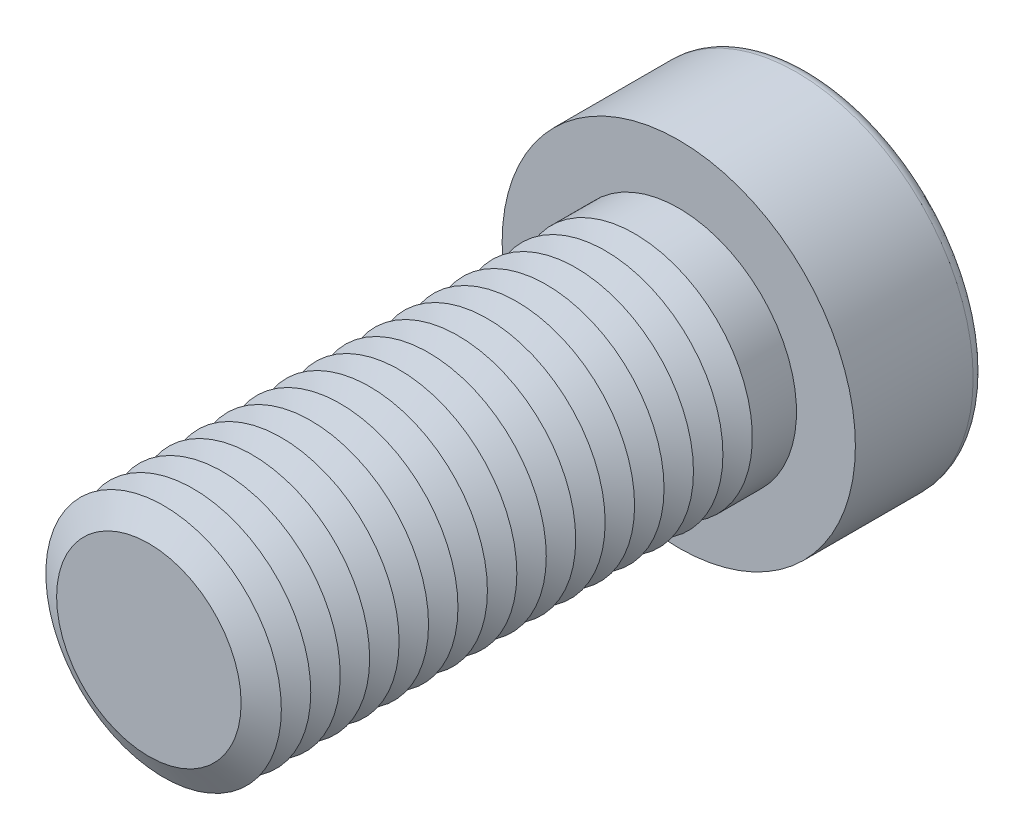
ISO-10303-21;
HEADER;
FILE_DESCRIPTION(('STEP AP214'),'2;1');
FILE_NAME('part.step','',(''),(''),'','','');
FILE_SCHEMA(('AUTOMOTIVE_DESIGN { 1 0 10303 214 1 1 1 1 }'));
ENDSEC;
DATA;
#1=APPLICATION_CONTEXT('core data for automotive mechanical design processes');
#2=APPLICATION_PROTOCOL_DEFINITION('international standard','automotive_design',2000,#1);
#3=PRODUCT_CONTEXT('',#1,'mechanical');
#4=PRODUCT('Part','Part','',(#3));
#5=PRODUCT_RELATED_PRODUCT_CATEGORY('part','',(#4));
#6=PRODUCT_DEFINITION_FORMATION('','',#4);
#7=PRODUCT_DEFINITION_CONTEXT('part definition',#1,'design');
#8=PRODUCT_DEFINITION('design','',#6,#7);
#9=PRODUCT_DEFINITION_SHAPE('','',#8);
#10=(LENGTH_UNIT() NAMED_UNIT(*) SI_UNIT(.MILLI.,.METRE.));
#11=(NAMED_UNIT(*) PLANE_ANGLE_UNIT() SI_UNIT($,.RADIAN.));
#12=(NAMED_UNIT(*) SI_UNIT($,.STERADIAN.) SOLID_ANGLE_UNIT());
#13=UNCERTAINTY_MEASURE_WITH_UNIT(LENGTH_MEASURE(1.E-05),#10,'distance_accuracy_value','');
#14=(GEOMETRIC_REPRESENTATION_CONTEXT(3) GLOBAL_UNCERTAINTY_ASSIGNED_CONTEXT((#13)) GLOBAL_UNIT_ASSIGNED_CONTEXT((#10,
#11,#12)) REPRESENTATION_CONTEXT('',''));
#15=CARTESIAN_POINT('',(0.,0.,0.));
#16=DIRECTION('',(0.,0.,1.));
#17=DIRECTION('',(1.,0.,0.));
#18=AXIS2_PLACEMENT_3D('',#15,#16,#17);
#19=CARTESIAN_POINT('',(0.,0.,36.25));
#20=DIRECTION('',(0.,0.,1.));
#21=DIRECTION('',(1.,0.,0.));
#22=AXIS2_PLACEMENT_3D('',#19,#20,#21);
#23=CONICAL_SURFACE('',#22,10.,1.0471975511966);
#24=CARTESIAN_POINT('',(0.,0.,35.));
#25=DIRECTION('',(0.,0.,1.));
#26=DIRECTION('',(1.,0.,0.));
#27=AXIS2_PLACEMENT_3D('',#24,#25,#26);
#28=CIRCLE('',#27,7.8349364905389);
#29=CARTESIAN_POINT('',(7.8349364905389,0.,35.));
#30=VERTEX_POINT('',#29);
#31=EDGE_CURVE('E313',#30,#30,#28,.T.);
#32=ORIENTED_EDGE('',*,*,#31,.T.);
#33=EDGE_LOOP('',(#32));
#34=FACE_BOUND('',#33,.T.);
#35=CARTESIAN_POINT('',(0.,0.,36.25));
#36=DIRECTION('',(0.,0.,1.));
#37=DIRECTION('',(1.,0.,0.));
#38=AXIS2_PLACEMENT_3D('',#35,#36,#37);
#39=CIRCLE('',#38,10.);
#40=CARTESIAN_POINT('',(10.,0.,36.25));
#41=VERTEX_POINT('',#40);
#42=EDGE_CURVE('E316',#41,#41,#39,.T.);
#43=ORIENTED_EDGE('',*,*,#42,.F.);
#44=EDGE_LOOP('',(#43));
#45=FACE_BOUND('',#44,.T.);
#46=ADVANCED_FACE('F39',(#34,#45),#23,.T.);
#47=CARTESIAN_POINT('',(0.,0.,35.));
#48=DIRECTION('',(0.,0.,-1.));
#49=DIRECTION('',(-1.,0.,0.));
#50=AXIS2_PLACEMENT_3D('',#47,#48,#49);
#51=CONICAL_SURFACE('',#50,7.8349364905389,1.0471975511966);
#52=CARTESIAN_POINT('',(0.,0.,33.75));
#53=DIRECTION('',(0.,0.,1.));
#54=DIRECTION('',(1.,0.,0.));
#55=AXIS2_PLACEMENT_3D('',#52,#53,#54);
#56=CIRCLE('',#55,10.);
#57=CARTESIAN_POINT('',(10.,0.,33.75));
#58=VERTEX_POINT('',#57);
#59=EDGE_CURVE('E324',#58,#58,#56,.T.);
#60=ORIENTED_EDGE('',*,*,#59,.T.);
#61=EDGE_LOOP('',(#60));
#62=FACE_BOUND('',#61,.T.);
#63=ORIENTED_EDGE('',*,*,#31,.F.);
#64=EDGE_LOOP('',(#63));
#65=FACE_BOUND('',#64,.T.);
#66=ADVANCED_FACE('F245',(#62,#65),#51,.T.);
#67=CARTESIAN_POINT('',(0.,0.,45.));
#68=DIRECTION('',(0.,0.,1.));
#69=DIRECTION('',(1.,0.,0.));
#70=AXIS2_PLACEMENT_3D('',#67,#68,#69);
#71=PLANE('',#70);
#72=CARTESIAN_POINT('',(0.,0.,45.));
#73=DIRECTION('',(0.,0.,1.));
#74=DIRECTION('',(1.,0.,0.));
#75=AXIS2_PLACEMENT_3D('',#72,#73,#74);
#76=CIRCLE('',#75,7.8349364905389);
#77=CARTESIAN_POINT('',(7.8349364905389,0.,45.));
#78=VERTEX_POINT('',#77);
#79=EDGE_CURVE('E174',#78,#78,#76,.T.);
#80=ORIENTED_EDGE('',*,*,#79,.T.);
#81=EDGE_LOOP('',(#80));
#82=FACE_BOUND('',#81,.T.);
#83=ADVANCED_FACE('F251',(#82),#71,.T.);
#84=CARTESIAN_POINT('',(0.,0.,45.));
#85=DIRECTION('',(0.,0.,-1.));
#86=DIRECTION('',(-1.,0.,0.));
#87=AXIS2_PLACEMENT_3D('',#84,#85,#86);
#88=CONICAL_SURFACE('',#87,7.8349364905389,1.0471975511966);
#89=CARTESIAN_POINT('',(0.,0.,43.75));
#90=DIRECTION('',(0.,0.,1.));
#91=DIRECTION('',(1.,0.,0.));
#92=AXIS2_PLACEMENT_3D('',#89,#90,#91);
#93=CIRCLE('',#92,10.);
#94=CARTESIAN_POINT('',(10.,0.,43.75));
#95=VERTEX_POINT('',#94);
#96=EDGE_CURVE('E291',#95,#95,#93,.T.);
#97=ORIENTED_EDGE('',*,*,#96,.T.);
#98=EDGE_LOOP('',(#97));
#99=FACE_BOUND('',#98,.T.);
#100=ORIENTED_EDGE('',*,*,#79,.F.);
#101=EDGE_LOOP('',(#100));
#102=FACE_BOUND('',#101,.T.);
#103=ADVANCED_FACE('F199',(#99,#102),#88,.T.);
#104=CARTESIAN_POINT('',(0.,0.,43.75));
#105=DIRECTION('',(0.,0.,1.));
#106=DIRECTION('',(1.,0.,0.));
#107=AXIS2_PLACEMENT_3D('',#104,#105,#106);
#108=CONICAL_SURFACE('',#107,10.,1.0471975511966);
#109=CARTESIAN_POINT('',(0.,0.,42.5));
#110=DIRECTION('',(0.,0.,1.));
#111=DIRECTION('',(1.,0.,0.));
#112=AXIS2_PLACEMENT_3D('',#109,#110,#111);
#113=CIRCLE('',#112,7.8349364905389);
#114=CARTESIAN_POINT('',(7.8349364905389,0.,42.5));
#115=VERTEX_POINT('',#114);
#116=EDGE_CURVE('E288',#115,#115,#113,.T.);
#117=ORIENTED_EDGE('',*,*,#116,.T.);
#118=EDGE_LOOP('',(#117));
#119=FACE_BOUND('',#118,.T.);
#120=ORIENTED_EDGE('',*,*,#96,.F.);
#121=EDGE_LOOP('',(#120));
#122=FACE_BOUND('',#121,.T.);
#123=ADVANCED_FACE('F277',(#119,#122),#108,.T.);
#124=CARTESIAN_POINT('',(0.,0.,42.5));
#125=DIRECTION('',(0.,0.,-1.));
#126=DIRECTION('',(-1.,0.,0.));
#127=AXIS2_PLACEMENT_3D('',#124,#125,#126);
#128=CONICAL_SURFACE('',#127,7.8349364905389,1.0471975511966);
#129=CARTESIAN_POINT('',(0.,0.,41.25));
#130=DIRECTION('',(0.,0.,1.));
#131=DIRECTION('',(1.,0.,0.));
#132=AXIS2_PLACEMENT_3D('',#129,#130,#131);
#133=CIRCLE('',#132,10.);
#134=CARTESIAN_POINT('',(10.,0.,41.25));
#135=VERTEX_POINT('',#134);
#136=EDGE_CURVE('E300',#135,#135,#133,.T.);
#137=ORIENTED_EDGE('',*,*,#136,.T.);
#138=EDGE_LOOP('',(#137));
#139=FACE_BOUND('',#138,.T.);
#140=ORIENTED_EDGE('',*,*,#116,.F.);
#141=EDGE_LOOP('',(#140));
#142=FACE_BOUND('',#141,.T.);
#143=ADVANCED_FACE('F274',(#139,#142),#128,.T.);
#144=CARTESIAN_POINT('',(0.,0.,41.25));
#145=DIRECTION('',(0.,0.,1.));
#146=DIRECTION('',(1.,0.,0.));
#147=AXIS2_PLACEMENT_3D('',#144,#145,#146);
#148=CONICAL_SURFACE('',#147,10.,1.0471975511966);
#149=CARTESIAN_POINT('',(0.,0.,40.));
#150=DIRECTION('',(0.,0.,1.));
#151=DIRECTION('',(1.,0.,0.));
#152=AXIS2_PLACEMENT_3D('',#149,#150,#151);
#153=CIRCLE('',#152,7.8349364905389);
#154=CARTESIAN_POINT('',(7.8349364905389,0.,40.));
#155=VERTEX_POINT('',#154);
#156=EDGE_CURVE('E293',#155,#155,#153,.T.);
#157=ORIENTED_EDGE('',*,*,#156,.T.);
#158=EDGE_LOOP('',(#157));
#159=FACE_BOUND('',#158,.T.);
#160=ORIENTED_EDGE('',*,*,#136,.F.);
#161=EDGE_LOOP('',(#160));
#162=FACE_BOUND('',#161,.T.);
#163=ADVANCED_FACE('F270',(#159,#162),#148,.T.);
#164=CARTESIAN_POINT('',(0.,0.,40.));
#165=DIRECTION('',(0.,0.,-1.));
#166=DIRECTION('',(-1.,0.,0.));
#167=AXIS2_PLACEMENT_3D('',#164,#165,#166);
#168=CONICAL_SURFACE('',#167,7.8349364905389,1.0471975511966);
#169=CARTESIAN_POINT('',(0.,0.,38.75));
#170=DIRECTION('',(0.,0.,1.));
#171=DIRECTION('',(1.,0.,0.));
#172=AXIS2_PLACEMENT_3D('',#169,#170,#171);
#173=CIRCLE('',#172,10.);
#174=CARTESIAN_POINT('',(10.,0.,38.75));
#175=VERTEX_POINT('',#174);
#176=EDGE_CURVE('E309',#175,#175,#173,.T.);
#177=ORIENTED_EDGE('',*,*,#176,.T.);
#178=EDGE_LOOP('',(#177));
#179=FACE_BOUND('',#178,.T.);
#180=ORIENTED_EDGE('',*,*,#156,.F.);
#181=EDGE_LOOP('',(#180));
#182=FACE_BOUND('',#181,.T.);
#183=ADVANCED_FACE('F266',(#179,#182),#168,.T.);
#184=CARTESIAN_POINT('',(0.,0.,38.75));
#185=DIRECTION('',(0.,0.,1.));
#186=DIRECTION('',(1.,0.,0.));
#187=AXIS2_PLACEMENT_3D('',#184,#185,#186);
#188=CONICAL_SURFACE('',#187,10.,1.0471975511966);
#189=CARTESIAN_POINT('',(0.,0.,37.5));
#190=DIRECTION('',(0.,0.,1.));
#191=DIRECTION('',(1.,0.,0.));
#192=AXIS2_PLACEMENT_3D('',#189,#190,#191);
#193=CIRCLE('',#192,7.8349364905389);
#194=CARTESIAN_POINT('',(7.8349364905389,0.,37.5));
#195=VERTEX_POINT('',#194);
#196=EDGE_CURVE('E305',#195,#195,#193,.T.);
#197=ORIENTED_EDGE('',*,*,#196,.T.);
#198=EDGE_LOOP('',(#197));
#199=FACE_BOUND('',#198,.T.);
#200=ORIENTED_EDGE('',*,*,#176,.F.);
#201=EDGE_LOOP('',(#200));
#202=FACE_BOUND('',#201,.T.);
#203=ADVANCED_FACE('F262',(#199,#202),#188,.T.);
#204=CARTESIAN_POINT('',(0.,0.,37.5));
#205=DIRECTION('',(0.,0.,-1.));
#206=DIRECTION('',(-1.,0.,0.));
#207=AXIS2_PLACEMENT_3D('',#204,#205,#206);
#208=CONICAL_SURFACE('',#207,7.8349364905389,1.0471975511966);
#209=ORIENTED_EDGE('',*,*,#42,.T.);
#210=EDGE_LOOP('',(#209));
#211=FACE_BOUND('',#210,.T.);
#212=ORIENTED_EDGE('',*,*,#196,.F.);
#213=EDGE_LOOP('',(#212));
#214=FACE_BOUND('',#213,.T.);
#215=ADVANCED_FACE('F258',(#211,#214),#208,.T.);
#216=CARTESIAN_POINT('',(0.,0.,33.75));
#217=DIRECTION('',(0.,0.,1.));
#218=DIRECTION('',(1.,0.,0.));
#219=AXIS2_PLACEMENT_3D('',#216,#217,#218);
#220=CONICAL_SURFACE('',#219,10.,1.0471975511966);
#221=CARTESIAN_POINT('',(0.,0.,32.5));
#222=DIRECTION('',(0.,0.,1.));
#223=DIRECTION('',(1.,0.,0.));
#224=AXIS2_PLACEMENT_3D('',#221,#222,#223);
#225=CIRCLE('',#224,7.8349364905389);
#226=CARTESIAN_POINT('',(7.8349364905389,0.,32.5));
#227=VERTEX_POINT('',#226);
#228=EDGE_CURVE('E320',#227,#227,#225,.T.);
#229=ORIENTED_EDGE('',*,*,#228,.T.);
#230=EDGE_LOOP('',(#229));
#231=FACE_BOUND('',#230,.T.);
#232=ORIENTED_EDGE('',*,*,#59,.F.);
#233=EDGE_LOOP('',(#232));
#234=FACE_BOUND('',#233,.T.);
#235=ADVANCED_FACE('F261',(#231,#234),#220,.T.);
#236=CARTESIAN_POINT('',(0.,0.,32.5));
#237=DIRECTION('',(0.,0.,-1.));
#238=DIRECTION('',(-1.,0.,0.));
#239=AXIS2_PLACEMENT_3D('',#236,#237,#238);
#240=CONICAL_SURFACE('',#239,7.8349364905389,1.0471975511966);
#241=CARTESIAN_POINT('',(0.,0.,31.25));
#242=DIRECTION('',(0.,0.,1.));
#243=DIRECTION('',(1.,0.,0.));
#244=AXIS2_PLACEMENT_3D('',#241,#242,#243);
#245=CIRCLE('',#244,10.);
#246=CARTESIAN_POINT('',(10.,0.,31.25));
#247=VERTEX_POINT('',#246);
#248=EDGE_CURVE('E332',#247,#247,#245,.T.);
#249=ORIENTED_EDGE('',*,*,#248,.T.);
#250=EDGE_LOOP('',(#249));
#251=FACE_BOUND('',#250,.T.);
#252=ORIENTED_EDGE('',*,*,#228,.F.);
#253=EDGE_LOOP('',(#252));
#254=FACE_BOUND('',#253,.T.);
#255=ADVANCED_FACE('F512',(#251,#254),#240,.T.);
#256=CARTESIAN_POINT('',(0.,0.,31.25));
#257=DIRECTION('',(0.,0.,1.));
#258=DIRECTION('',(1.,0.,0.));
#259=AXIS2_PLACEMENT_3D('',#256,#257,#258);
#260=CONICAL_SURFACE('',#259,10.,1.0471975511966);
#261=CARTESIAN_POINT('',(0.,0.,30.));
#262=DIRECTION('',(0.,0.,1.));
#263=DIRECTION('',(1.,0.,0.));
#264=AXIS2_PLACEMENT_3D('',#261,#262,#263);
#265=CIRCLE('',#264,7.8349364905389);
#266=CARTESIAN_POINT('',(7.8349364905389,0.,30.));
#267=VERTEX_POINT('',#266);
#268=EDGE_CURVE('E328',#267,#267,#265,.T.);
#269=ORIENTED_EDGE('',*,*,#268,.T.);
#270=EDGE_LOOP('',(#269));
#271=FACE_BOUND('',#270,.T.);
#272=ORIENTED_EDGE('',*,*,#248,.F.);
#273=EDGE_LOOP('',(#272));
#274=FACE_BOUND('',#273,.T.);
#275=ADVANCED_FACE('F508',(#271,#274),#260,.T.);
#276=CARTESIAN_POINT('',(0.,0.,30.));
#277=DIRECTION('',(0.,0.,-1.));
#278=DIRECTION('',(-1.,0.,0.));
#279=AXIS2_PLACEMENT_3D('',#276,#277,#278);
#280=CONICAL_SURFACE('',#279,7.8349364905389,1.0471975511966);
#281=CARTESIAN_POINT('',(0.,0.,28.75));
#282=DIRECTION('',(0.,0.,1.));
#283=DIRECTION('',(1.,0.,0.));
#284=AXIS2_PLACEMENT_3D('',#281,#282,#283);
#285=CIRCLE('',#284,10.);
#286=CARTESIAN_POINT('',(10.,0.,28.75));
#287=VERTEX_POINT('',#286);
#288=EDGE_CURVE('E340',#287,#287,#285,.T.);
#289=ORIENTED_EDGE('',*,*,#288,.T.);
#290=EDGE_LOOP('',(#289));
#291=FACE_BOUND('',#290,.T.);
#292=ORIENTED_EDGE('',*,*,#268,.F.);
#293=EDGE_LOOP('',(#292));
#294=FACE_BOUND('',#293,.T.);
#295=ADVANCED_FACE('F504',(#291,#294),#280,.T.);
#296=CARTESIAN_POINT('',(0.,0.,28.75));
#297=DIRECTION('',(0.,0.,1.));
#298=DIRECTION('',(1.,0.,0.));
#299=AXIS2_PLACEMENT_3D('',#296,#297,#298);
#300=CONICAL_SURFACE('',#299,10.,1.0471975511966);
#301=CARTESIAN_POINT('',(0.,0.,27.5));
#302=DIRECTION('',(0.,0.,1.));
#303=DIRECTION('',(1.,0.,0.));
#304=AXIS2_PLACEMENT_3D('',#301,#302,#303);
#305=CIRCLE('',#304,7.8349364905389);
#306=CARTESIAN_POINT('',(7.8349364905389,0.,27.5));
#307=VERTEX_POINT('',#306);
#308=EDGE_CURVE('E336',#307,#307,#305,.T.);
#309=ORIENTED_EDGE('',*,*,#308,.T.);
#310=EDGE_LOOP('',(#309));
#311=FACE_BOUND('',#310,.T.);
#312=ORIENTED_EDGE('',*,*,#288,.F.);
#313=EDGE_LOOP('',(#312));
#314=FACE_BOUND('',#313,.T.);
#315=ADVANCED_FACE('F500',(#311,#314),#300,.T.);
#316=CARTESIAN_POINT('',(0.,0.,27.5));
#317=DIRECTION('',(0.,0.,-1.));
#318=DIRECTION('',(-1.,0.,0.));
#319=AXIS2_PLACEMENT_3D('',#316,#317,#318);
#320=CONICAL_SURFACE('',#319,7.8349364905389,1.0471975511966);
#321=CARTESIAN_POINT('',(0.,0.,26.25));
#322=DIRECTION('',(0.,0.,1.));
#323=DIRECTION('',(1.,0.,0.));
#324=AXIS2_PLACEMENT_3D('',#321,#322,#323);
#325=CIRCLE('',#324,10.);
#326=CARTESIAN_POINT('',(10.,0.,26.25));
#327=VERTEX_POINT('',#326);
#328=EDGE_CURVE('E348',#327,#327,#325,.T.);
#329=ORIENTED_EDGE('',*,*,#328,.T.);
#330=EDGE_LOOP('',(#329));
#331=FACE_BOUND('',#330,.T.);
#332=ORIENTED_EDGE('',*,*,#308,.F.);
#333=EDGE_LOOP('',(#332));
#334=FACE_BOUND('',#333,.T.);
#335=ADVANCED_FACE('F496',(#331,#334),#320,.T.);
#336=CARTESIAN_POINT('',(0.,0.,26.25));
#337=DIRECTION('',(0.,0.,1.));
#338=DIRECTION('',(1.,0.,0.));
#339=AXIS2_PLACEMENT_3D('',#336,#337,#338);
#340=CONICAL_SURFACE('',#339,10.,1.0471975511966);
#341=CARTESIAN_POINT('',(0.,0.,25.));
#342=DIRECTION('',(0.,0.,1.));
#343=DIRECTION('',(1.,0.,0.));
#344=AXIS2_PLACEMENT_3D('',#341,#342,#343);
#345=CIRCLE('',#344,7.8349364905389);
#346=CARTESIAN_POINT('',(7.8349364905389,0.,25.));
#347=VERTEX_POINT('',#346);
#348=EDGE_CURVE('E344',#347,#347,#345,.T.);
#349=ORIENTED_EDGE('',*,*,#348,.T.);
#350=EDGE_LOOP('',(#349));
#351=FACE_BOUND('',#350,.T.);
#352=ORIENTED_EDGE('',*,*,#328,.F.);
#353=EDGE_LOOP('',(#352));
#354=FACE_BOUND('',#353,.T.);
#355=ADVANCED_FACE('F492',(#351,#354),#340,.T.);
#356=CARTESIAN_POINT('',(0.,0.,25.));
#357=DIRECTION('',(0.,0.,-1.));
#358=DIRECTION('',(-1.,0.,0.));
#359=AXIS2_PLACEMENT_3D('',#356,#357,#358);
#360=CONICAL_SURFACE('',#359,7.8349364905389,1.0471975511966);
#361=CARTESIAN_POINT('',(0.,0.,23.75));
#362=DIRECTION('',(0.,0.,1.));
#363=DIRECTION('',(1.,0.,0.));
#364=AXIS2_PLACEMENT_3D('',#361,#362,#363);
#365=CIRCLE('',#364,10.);
#366=CARTESIAN_POINT('',(10.,0.,23.75));
#367=VERTEX_POINT('',#366);
#368=EDGE_CURVE('E356',#367,#367,#365,.T.);
#369=ORIENTED_EDGE('',*,*,#368,.T.);
#370=EDGE_LOOP('',(#369));
#371=FACE_BOUND('',#370,.T.);
#372=ORIENTED_EDGE('',*,*,#348,.F.);
#373=EDGE_LOOP('',(#372));
#374=FACE_BOUND('',#373,.T.);
#375=ADVANCED_FACE('F488',(#371,#374),#360,.T.);
#376=CARTESIAN_POINT('',(0.,0.,23.75));
#377=DIRECTION('',(0.,0.,1.));
#378=DIRECTION('',(1.,0.,0.));
#379=AXIS2_PLACEMENT_3D('',#376,#377,#378);
#380=CONICAL_SURFACE('',#379,10.,1.0471975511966);
#381=CARTESIAN_POINT('',(0.,0.,22.5));
#382=DIRECTION('',(0.,0.,1.));
#383=DIRECTION('',(1.,0.,0.));
#384=AXIS2_PLACEMENT_3D('',#381,#382,#383);
#385=CIRCLE('',#384,7.8349364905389);
#386=CARTESIAN_POINT('',(7.8349364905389,0.,22.5));
#387=VERTEX_POINT('',#386);
#388=EDGE_CURVE('E352',#387,#387,#385,.T.);
#389=ORIENTED_EDGE('',*,*,#388,.T.);
#390=EDGE_LOOP('',(#389));
#391=FACE_BOUND('',#390,.T.);
#392=ORIENTED_EDGE('',*,*,#368,.F.);
#393=EDGE_LOOP('',(#392));
#394=FACE_BOUND('',#393,.T.);
#395=ADVANCED_FACE('F484',(#391,#394),#380,.T.);
#396=CARTESIAN_POINT('',(0.,0.,22.5));
#397=DIRECTION('',(0.,0.,-1.));
#398=DIRECTION('',(-1.,0.,0.));
#399=AXIS2_PLACEMENT_3D('',#396,#397,#398);
#400=CONICAL_SURFACE('',#399,7.8349364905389,1.0471975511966);
#401=CARTESIAN_POINT('',(0.,0.,21.25));
#402=DIRECTION('',(0.,0.,1.));
#403=DIRECTION('',(1.,0.,0.));
#404=AXIS2_PLACEMENT_3D('',#401,#402,#403);
#405=CIRCLE('',#404,10.);
#406=CARTESIAN_POINT('',(10.,0.,21.25));
#407=VERTEX_POINT('',#406);
#408=EDGE_CURVE('E364',#407,#407,#405,.T.);
#409=ORIENTED_EDGE('',*,*,#408,.T.);
#410=EDGE_LOOP('',(#409));
#411=FACE_BOUND('',#410,.T.);
#412=ORIENTED_EDGE('',*,*,#388,.F.);
#413=EDGE_LOOP('',(#412));
#414=FACE_BOUND('',#413,.T.);
#415=ADVANCED_FACE('F480',(#411,#414),#400,.T.);
#416=CARTESIAN_POINT('',(0.,0.,21.25));
#417=DIRECTION('',(0.,0.,1.));
#418=DIRECTION('',(1.,0.,0.));
#419=AXIS2_PLACEMENT_3D('',#416,#417,#418);
#420=CONICAL_SURFACE('',#419,10.,1.0471975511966);
#421=CARTESIAN_POINT('',(0.,0.,20.));
#422=DIRECTION('',(0.,0.,1.));
#423=DIRECTION('',(1.,0.,0.));
#424=AXIS2_PLACEMENT_3D('',#421,#422,#423);
#425=CIRCLE('',#424,7.8349364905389);
#426=CARTESIAN_POINT('',(7.8349364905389,0.,20.));
#427=VERTEX_POINT('',#426);
#428=EDGE_CURVE('E360',#427,#427,#425,.T.);
#429=ORIENTED_EDGE('',*,*,#428,.T.);
#430=EDGE_LOOP('',(#429));
#431=FACE_BOUND('',#430,.T.);
#432=ORIENTED_EDGE('',*,*,#408,.F.);
#433=EDGE_LOOP('',(#432));
#434=FACE_BOUND('',#433,.T.);
#435=ADVANCED_FACE('F476',(#431,#434),#420,.T.);
#436=CARTESIAN_POINT('',(0.,0.,20.));
#437=DIRECTION('',(0.,0.,-1.));
#438=DIRECTION('',(-1.,0.,0.));
#439=AXIS2_PLACEMENT_3D('',#436,#437,#438);
#440=CONICAL_SURFACE('',#439,7.8349364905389,1.0471975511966);
#441=CARTESIAN_POINT('',(0.,0.,18.75));
#442=DIRECTION('',(0.,0.,1.));
#443=DIRECTION('',(1.,0.,0.));
#444=AXIS2_PLACEMENT_3D('',#441,#442,#443);
#445=CIRCLE('',#444,10.);
#446=CARTESIAN_POINT('',(10.,0.,18.75));
#447=VERTEX_POINT('',#446);
#448=EDGE_CURVE('E372',#447,#447,#445,.T.);
#449=ORIENTED_EDGE('',*,*,#448,.T.);
#450=EDGE_LOOP('',(#449));
#451=FACE_BOUND('',#450,.T.);
#452=ORIENTED_EDGE('',*,*,#428,.F.);
#453=EDGE_LOOP('',(#452));
#454=FACE_BOUND('',#453,.T.);
#455=ADVANCED_FACE('F472',(#451,#454),#440,.T.);
#456=CARTESIAN_POINT('',(0.,0.,18.75));
#457=DIRECTION('',(0.,0.,1.));
#458=DIRECTION('',(1.,0.,0.));
#459=AXIS2_PLACEMENT_3D('',#456,#457,#458);
#460=CONICAL_SURFACE('',#459,10.,1.0471975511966);
#461=CARTESIAN_POINT('',(0.,0.,17.5));
#462=DIRECTION('',(0.,0.,1.));
#463=DIRECTION('',(1.,0.,0.));
#464=AXIS2_PLACEMENT_3D('',#461,#462,#463);
#465=CIRCLE('',#464,7.8349364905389);
#466=CARTESIAN_POINT('',(7.8349364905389,0.,17.5));
#467=VERTEX_POINT('',#466);
#468=EDGE_CURVE('E368',#467,#467,#465,.T.);
#469=ORIENTED_EDGE('',*,*,#468,.T.);
#470=EDGE_LOOP('',(#469));
#471=FACE_BOUND('',#470,.T.);
#472=ORIENTED_EDGE('',*,*,#448,.F.);
#473=EDGE_LOOP('',(#472));
#474=FACE_BOUND('',#473,.T.);
#475=ADVANCED_FACE('F468',(#471,#474),#460,.T.);
#476=CARTESIAN_POINT('',(0.,0.,17.5));
#477=DIRECTION('',(0.,0.,-1.));
#478=DIRECTION('',(-1.,0.,0.));
#479=AXIS2_PLACEMENT_3D('',#476,#477,#478);
#480=CONICAL_SURFACE('',#479,7.8349364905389,1.0471975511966);
#481=CARTESIAN_POINT('',(0.,0.,16.25));
#482=DIRECTION('',(0.,0.,1.));
#483=DIRECTION('',(1.,0.,0.));
#484=AXIS2_PLACEMENT_3D('',#481,#482,#483);
#485=CIRCLE('',#484,10.);
#486=CARTESIAN_POINT('',(10.,0.,16.25));
#487=VERTEX_POINT('',#486);
#488=EDGE_CURVE('E380',#487,#487,#485,.T.);
#489=ORIENTED_EDGE('',*,*,#488,.T.);
#490=EDGE_LOOP('',(#489));
#491=FACE_BOUND('',#490,.T.);
#492=ORIENTED_EDGE('',*,*,#468,.F.);
#493=EDGE_LOOP('',(#492));
#494=FACE_BOUND('',#493,.T.);
#495=ADVANCED_FACE('F464',(#491,#494),#480,.T.);
#496=CARTESIAN_POINT('',(0.,0.,16.25));
#497=DIRECTION('',(0.,0.,1.));
#498=DIRECTION('',(1.,0.,0.));
#499=AXIS2_PLACEMENT_3D('',#496,#497,#498);
#500=CONICAL_SURFACE('',#499,10.,1.0471975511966);
#501=CARTESIAN_POINT('',(0.,0.,15.));
#502=DIRECTION('',(0.,0.,1.));
#503=DIRECTION('',(1.,0.,0.));
#504=AXIS2_PLACEMENT_3D('',#501,#502,#503);
#505=CIRCLE('',#504,7.8349364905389);
#506=CARTESIAN_POINT('',(7.8349364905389,0.,15.));
#507=VERTEX_POINT('',#506);
#508=EDGE_CURVE('E376',#507,#507,#505,.T.);
#509=ORIENTED_EDGE('',*,*,#508,.T.);
#510=EDGE_LOOP('',(#509));
#511=FACE_BOUND('',#510,.T.);
#512=ORIENTED_EDGE('',*,*,#488,.F.);
#513=EDGE_LOOP('',(#512));
#514=FACE_BOUND('',#513,.T.);
#515=ADVANCED_FACE('F460',(#511,#514),#500,.T.);
#516=CARTESIAN_POINT('',(0.,0.,15.));
#517=DIRECTION('',(0.,0.,-1.));
#518=DIRECTION('',(-1.,0.,0.));
#519=AXIS2_PLACEMENT_3D('',#516,#517,#518);
#520=CONICAL_SURFACE('',#519,7.8349364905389,1.0471975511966);
#521=CARTESIAN_POINT('',(0.,0.,13.75));
#522=DIRECTION('',(0.,0.,1.));
#523=DIRECTION('',(1.,0.,0.));
#524=AXIS2_PLACEMENT_3D('',#521,#522,#523);
#525=CIRCLE('',#524,10.);
#526=CARTESIAN_POINT('',(10.,0.,13.75));
#527=VERTEX_POINT('',#526);
#528=EDGE_CURVE('E388',#527,#527,#525,.T.);
#529=ORIENTED_EDGE('',*,*,#528,.T.);
#530=EDGE_LOOP('',(#529));
#531=FACE_BOUND('',#530,.T.);
#532=ORIENTED_EDGE('',*,*,#508,.F.);
#533=EDGE_LOOP('',(#532));
#534=FACE_BOUND('',#533,.T.);
#535=ADVANCED_FACE('F456',(#531,#534),#520,.T.);
#536=CARTESIAN_POINT('',(0.,0.,13.75));
#537=DIRECTION('',(0.,0.,1.));
#538=DIRECTION('',(1.,0.,0.));
#539=AXIS2_PLACEMENT_3D('',#536,#537,#538);
#540=CONICAL_SURFACE('',#539,10.,1.0471975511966);
#541=CARTESIAN_POINT('',(0.,0.,12.5));
#542=DIRECTION('',(0.,0.,1.));
#543=DIRECTION('',(1.,0.,0.));
#544=AXIS2_PLACEMENT_3D('',#541,#542,#543);
#545=CIRCLE('',#544,7.8349364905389);
#546=CARTESIAN_POINT('',(7.8349364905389,0.,12.5));
#547=VERTEX_POINT('',#546);
#548=EDGE_CURVE('E384',#547,#547,#545,.T.);
#549=ORIENTED_EDGE('',*,*,#548,.T.);
#550=EDGE_LOOP('',(#549));
#551=FACE_BOUND('',#550,.T.);
#552=ORIENTED_EDGE('',*,*,#528,.F.);
#553=EDGE_LOOP('',(#552));
#554=FACE_BOUND('',#553,.T.);
#555=ADVANCED_FACE('F452',(#551,#554),#540,.T.);
#556=CARTESIAN_POINT('',(0.,0.,12.5));
#557=DIRECTION('',(0.,0.,-1.));
#558=DIRECTION('',(-1.,0.,0.));
#559=AXIS2_PLACEMENT_3D('',#556,#557,#558);
#560=CONICAL_SURFACE('',#559,7.8349364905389,1.0471975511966);
#561=CARTESIAN_POINT('',(0.,0.,11.25));
#562=DIRECTION('',(0.,0.,1.));
#563=DIRECTION('',(1.,0.,0.));
#564=AXIS2_PLACEMENT_3D('',#561,#562,#563);
#565=CIRCLE('',#564,10.);
#566=CARTESIAN_POINT('',(10.,0.,11.25));
#567=VERTEX_POINT('',#566);
#568=EDGE_CURVE('E396',#567,#567,#565,.T.);
#569=ORIENTED_EDGE('',*,*,#568,.T.);
#570=EDGE_LOOP('',(#569));
#571=FACE_BOUND('',#570,.T.);
#572=ORIENTED_EDGE('',*,*,#548,.F.);
#573=EDGE_LOOP('',(#572));
#574=FACE_BOUND('',#573,.T.);
#575=ADVANCED_FACE('F448',(#571,#574),#560,.T.);
#576=CARTESIAN_POINT('',(0.,0.,11.25));
#577=DIRECTION('',(0.,0.,1.));
#578=DIRECTION('',(1.,0.,0.));
#579=AXIS2_PLACEMENT_3D('',#576,#577,#578);
#580=CONICAL_SURFACE('',#579,10.,1.0471975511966);
#581=CARTESIAN_POINT('',(0.,0.,9.99999999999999));
#582=DIRECTION('',(0.,0.,1.));
#583=DIRECTION('',(1.,0.,0.));
#584=AXIS2_PLACEMENT_3D('',#581,#582,#583);
#585=CIRCLE('',#584,7.8349364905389);
#586=CARTESIAN_POINT('',(7.8349364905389,0.,9.99999999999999));
#587=VERTEX_POINT('',#586);
#588=EDGE_CURVE('E392',#587,#587,#585,.T.);
#589=ORIENTED_EDGE('',*,*,#588,.T.);
#590=EDGE_LOOP('',(#589));
#591=FACE_BOUND('',#590,.T.);
#592=ORIENTED_EDGE('',*,*,#568,.F.);
#593=EDGE_LOOP('',(#592));
#594=FACE_BOUND('',#593,.T.);
#595=ADVANCED_FACE('F444',(#591,#594),#580,.T.);
#596=CARTESIAN_POINT('',(0.,0.,9.99999999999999));
#597=DIRECTION('',(0.,0.,-1.));
#598=DIRECTION('',(-1.,0.,0.));
#599=AXIS2_PLACEMENT_3D('',#596,#597,#598);
#600=CONICAL_SURFACE('',#599,7.8349364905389,1.0471975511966);
#601=CARTESIAN_POINT('',(0.,0.,8.75));
#602=DIRECTION('',(0.,0.,1.));
#603=DIRECTION('',(1.,0.,0.));
#604=AXIS2_PLACEMENT_3D('',#601,#602,#603);
#605=CIRCLE('',#604,10.);
#606=CARTESIAN_POINT('',(10.,0.,8.75));
#607=VERTEX_POINT('',#606);
#608=EDGE_CURVE('E404',#607,#607,#605,.T.);
#609=ORIENTED_EDGE('',*,*,#608,.T.);
#610=EDGE_LOOP('',(#609));
#611=FACE_BOUND('',#610,.T.);
#612=ORIENTED_EDGE('',*,*,#588,.F.);
#613=EDGE_LOOP('',(#612));
#614=FACE_BOUND('',#613,.T.);
#615=ADVANCED_FACE('F440',(#611,#614),#600,.T.);
#616=CARTESIAN_POINT('',(0.,0.,8.75));
#617=DIRECTION('',(0.,0.,1.));
#618=DIRECTION('',(1.,0.,0.));
#619=AXIS2_PLACEMENT_3D('',#616,#617,#618);
#620=CONICAL_SURFACE('',#619,10.,1.0471975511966);
#621=CARTESIAN_POINT('',(0.,0.,7.5));
#622=DIRECTION('',(0.,0.,1.));
#623=DIRECTION('',(1.,0.,0.));
#624=AXIS2_PLACEMENT_3D('',#621,#622,#623);
#625=CIRCLE('',#624,7.8349364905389);
#626=CARTESIAN_POINT('',(7.8349364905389,0.,7.5));
#627=VERTEX_POINT('',#626);
#628=EDGE_CURVE('E400',#627,#627,#625,.T.);
#629=ORIENTED_EDGE('',*,*,#628,.T.);
#630=EDGE_LOOP('',(#629));
#631=FACE_BOUND('',#630,.T.);
#632=ORIENTED_EDGE('',*,*,#608,.F.);
#633=EDGE_LOOP('',(#632));
#634=FACE_BOUND('',#633,.T.);
#635=ADVANCED_FACE('F435',(#631,#634),#620,.T.);
#636=CARTESIAN_POINT('',(0.,0.,7.5));
#637=DIRECTION('',(0.,0.,-1.));
#638=DIRECTION('',(-1.,0.,0.));
#639=AXIS2_PLACEMENT_3D('',#636,#637,#638);
#640=CONICAL_SURFACE('',#639,7.8349364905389,1.0471975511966);
#641=CARTESIAN_POINT('',(0.,0.,6.25));
#642=DIRECTION('',(0.,0.,1.));
#643=DIRECTION('',(1.,0.,0.));
#644=AXIS2_PLACEMENT_3D('',#641,#642,#643);
#645=CIRCLE('',#644,10.);
#646=CARTESIAN_POINT('',(10.,0.,6.25));
#647=VERTEX_POINT('',#646);
#648=EDGE_CURVE('E416',#647,#647,#645,.T.);
#649=ORIENTED_EDGE('',*,*,#648,.T.);
#650=EDGE_LOOP('',(#649));
#651=FACE_BOUND('',#650,.T.);
#652=ORIENTED_EDGE('',*,*,#628,.F.);
#653=EDGE_LOOP('',(#652));
#654=FACE_BOUND('',#653,.T.);
#655=ADVANCED_FACE('F421',(#651,#654),#640,.T.);
#656=CARTESIAN_POINT('',(0.,0.,6.25));
#657=DIRECTION('',(0.,0.,1.));
#658=DIRECTION('',(1.,0.,0.));
#659=AXIS2_PLACEMENT_3D('',#656,#657,#658);
#660=CONICAL_SURFACE('',#659,10.,1.0471975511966);
#661=CARTESIAN_POINT('',(0.,0.,5.));
#662=DIRECTION('',(0.,0.,1.));
#663=DIRECTION('',(1.,0.,0.));
#664=AXIS2_PLACEMENT_3D('',#661,#662,#663);
#665=CIRCLE('',#664,7.8349364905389);
#666=CARTESIAN_POINT('',(7.8349364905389,0.,5.));
#667=VERTEX_POINT('',#666);
#668=EDGE_CURVE('E408',#667,#667,#665,.T.);
#669=ORIENTED_EDGE('',*,*,#668,.T.);
#670=EDGE_LOOP('',(#669));
#671=FACE_BOUND('',#670,.T.);
#672=ORIENTED_EDGE('',*,*,#648,.F.);
#673=EDGE_LOOP('',(#672));
#674=FACE_BOUND('',#673,.T.);
#675=ADVANCED_FACE('F424',(#671,#674),#660,.T.);
#676=CARTESIAN_POINT('',(0.,0.,5.));
#677=DIRECTION('',(0.,0.,-1.));
#678=DIRECTION('',(-1.,0.,0.));
#679=AXIS2_PLACEMENT_3D('',#676,#677,#678);
#680=CONICAL_SURFACE('',#679,7.8349364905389,1.0471975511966);
#681=CARTESIAN_POINT('',(0.,0.,3.75));
#682=DIRECTION('',(0.,0.,1.));
#683=DIRECTION('',(1.,0.,0.));
#684=AXIS2_PLACEMENT_3D('',#681,#682,#683);
#685=CIRCLE('',#684,10.);
#686=CARTESIAN_POINT('',(-10.,0.,3.75));
#687=VERTEX_POINT('',#686);
#688=EDGE_CURVE('E412',#687,#687,#685,.T.);
#689=ORIENTED_EDGE('',*,*,#688,.T.);
#690=EDGE_LOOP('',(#689));
#691=FACE_BOUND('',#690,.T.);
#692=ORIENTED_EDGE('',*,*,#668,.F.);
#693=EDGE_LOOP('',(#692));
#694=FACE_BOUND('',#693,.T.);
#695=ADVANCED_FACE('F426',(#691,#694),#680,.T.);
#696=CARTESIAN_POINT('',(0.,0.,-0.499999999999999));
#697=DIRECTION('',(0.,0.,-1.));
#698=DIRECTION('',(-1.,0.,0.));
#699=AXIS2_PLACEMENT_3D('',#696,#697,#698);
#700=CONICAL_SURFACE('',#699,7.,1.0471975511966);
#701=CARTESIAN_POINT('',(0.,0.,3.54145188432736));
#702=VERTEX_POINT('',#701);
#703=VERTEX_LOOP('',#702);
#704=FACE_BOUND('',#703,.T.);
#705=CARTESIAN_POINT('',(0.,0.,-0.499999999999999));
#706=DIRECTION('',(0.,0.,-1.));
#707=DIRECTION('',(-1.,0.,0.));
#708=AXIS2_PLACEMENT_3D('',#705,#706,#707);
#709=CIRCLE('',#708,7.);
#710=CARTESIAN_POINT('',(-6.06217782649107,3.5,-0.499999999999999));
#711=VERTEX_POINT('',#710);
#712=CARTESIAN_POINT('',(0.,7.,-0.499999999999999));
#713=VERTEX_POINT('',#712);
#714=EDGE_CURVE('E149',#711,#713,#709,.T.);
#715=ORIENTED_EDGE('',*,*,#714,.T.);
#716=CARTESIAN_POINT('',(0.,0.,-0.499999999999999));
#717=DIRECTION('',(0.,0.,-1.));
#718=DIRECTION('',(-1.,0.,0.));
#719=AXIS2_PLACEMENT_3D('',#716,#717,#718);
#720=CIRCLE('',#719,7.);
#721=CARTESIAN_POINT('',(6.06217782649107,3.5,-0.499999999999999));
#722=VERTEX_POINT('',#721);
#723=EDGE_CURVE('E54',#713,#722,#720,.T.);
#724=ORIENTED_EDGE('',*,*,#723,.T.);
#725=CARTESIAN_POINT('',(6.06217782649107,-3.5,-0.499999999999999));
#726=VERTEX_POINT('',#725);
#727=EDGE_CURVE('E1028',#722,#726,#720,.T.);
#728=ORIENTED_EDGE('',*,*,#727,.T.);
#729=CARTESIAN_POINT('',(0.,-7.,-0.499999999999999));
#730=VERTEX_POINT('',#729);
#731=EDGE_CURVE('E1026',#726,#730,#720,.T.);
#732=ORIENTED_EDGE('',*,*,#731,.T.);
#733=CARTESIAN_POINT('',(-6.06217782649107,-3.5,-0.499999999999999));
#734=VERTEX_POINT('',#733);
#735=EDGE_CURVE('E1020',#730,#734,#720,.T.);
#736=ORIENTED_EDGE('',*,*,#735,.T.);
#737=EDGE_CURVE('E1018',#734,#711,#720,.T.);
#738=ORIENTED_EDGE('',*,*,#737,.T.);
#739=EDGE_LOOP('',(#715,#724,#728,#732,#736,#738));
#740=FACE_BOUND('',#739,.T.);
#741=ADVANCED_FACE('F201',(#704,#740),#700,.F.);
#742=CARTESIAN_POINT('',(0.,0.,-0.499999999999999));
#743=DIRECTION('',(0.,0.,-1.));
#744=DIRECTION('',(-1.,0.,0.));
#745=AXIS2_PLACEMENT_3D('',#742,#743,#744);
#746=PLANE('',#745);
#747=ORIENTED_EDGE('',*,*,#723,.F.);
#748=DIRECTION('',(1.,0.,0.));
#749=VECTOR('',#748,1.);
#750=CARTESIAN_POINT('',(-4.04145188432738,7.,-0.499999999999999));
#751=LINE('',#750,#749);
#752=CARTESIAN_POINT('',(4.04145188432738,7.,-0.499999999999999));
#753=VERTEX_POINT('',#752);
#754=EDGE_CURVE('E1071',#713,#753,#751,.T.);
#755=ORIENTED_EDGE('',*,*,#754,.T.);
#756=DIRECTION('',(0.5,-0.866025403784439,0.));
#757=VECTOR('',#756,1.);
#758=CARTESIAN_POINT('',(4.04145188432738,7.,-0.499999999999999));
#759=LINE('',#758,#757);
#760=EDGE_CURVE('E155',#753,#722,#759,.T.);
#761=ORIENTED_EDGE('',*,*,#760,.T.);
#762=EDGE_LOOP('',(#747,#755,#761));
#763=FACE_BOUND('',#762,.T.);
#764=ADVANCED_FACE('F607',(#763),#746,.T.);
#765=ORIENTED_EDGE('',*,*,#727,.F.);
#766=CARTESIAN_POINT('',(8.08290376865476,0.,-0.499999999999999));
#767=VERTEX_POINT('',#766);
#768=EDGE_CURVE('E1066',#722,#767,#759,.T.);
#769=ORIENTED_EDGE('',*,*,#768,.T.);
#770=DIRECTION('',(-0.5,-0.866025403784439,0.));
#771=VECTOR('',#770,1.);
#772=CARTESIAN_POINT('',(8.08290376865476,0.,-0.499999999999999));
#773=LINE('',#772,#771);
#774=EDGE_CURVE('E1040',#767,#726,#773,.T.);
#775=ORIENTED_EDGE('',*,*,#774,.T.);
#776=EDGE_LOOP('',(#765,#769,#775));
#777=FACE_BOUND('',#776,.T.);
#778=ADVANCED_FACE('F617',(#777),#746,.T.);
#779=ORIENTED_EDGE('',*,*,#731,.F.);
#780=CARTESIAN_POINT('',(4.04145188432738,-7.,-0.499999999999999));
#781=VERTEX_POINT('',#780);
#782=EDGE_CURVE('E1042',#726,#781,#773,.T.);
#783=ORIENTED_EDGE('',*,*,#782,.T.);
#784=DIRECTION('',(-1.,0.,0.));
#785=VECTOR('',#784,1.);
#786=CARTESIAN_POINT('',(4.04145188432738,-7.,-0.499999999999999));
#787=LINE('',#786,#785);
#788=EDGE_CURVE('E995',#781,#730,#787,.T.);
#789=ORIENTED_EDGE('',*,*,#788,.T.);
#790=EDGE_LOOP('',(#779,#783,#789));
#791=FACE_BOUND('',#790,.T.);
#792=ADVANCED_FACE('F627',(#791),#746,.T.);
#793=ORIENTED_EDGE('',*,*,#735,.F.);
#794=CARTESIAN_POINT('',(-4.04145188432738,-7.,-0.499999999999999));
#795=VERTEX_POINT('',#794);
#796=EDGE_CURVE('E1036',#730,#795,#787,.T.);
#797=ORIENTED_EDGE('',*,*,#796,.T.);
#798=DIRECTION('',(-0.5,0.866025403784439,0.));
#799=VECTOR('',#798,1.);
#800=CARTESIAN_POINT('',(-4.04145188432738,-7.,-0.499999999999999));
#801=LINE('',#800,#799);
#802=EDGE_CURVE('E1038',#795,#734,#801,.T.);
#803=ORIENTED_EDGE('',*,*,#802,.T.);
#804=EDGE_LOOP('',(#793,#797,#803));
#805=FACE_BOUND('',#804,.T.);
#806=ADVANCED_FACE('F635',(#805),#746,.T.);
#807=ORIENTED_EDGE('',*,*,#737,.F.);
#808=CARTESIAN_POINT('',(-8.08290376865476,0.,-0.499999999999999));
#809=VERTEX_POINT('',#808);
#810=EDGE_CURVE('E1044',#734,#809,#801,.T.);
#811=ORIENTED_EDGE('',*,*,#810,.T.);
#812=DIRECTION('',(0.5,0.866025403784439,0.));
#813=VECTOR('',#812,1.);
#814=CARTESIAN_POINT('',(-8.08290376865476,0.,-0.499999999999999));
#815=LINE('',#814,#813);
#816=EDGE_CURVE('E158',#809,#711,#815,.T.);
#817=ORIENTED_EDGE('',*,*,#816,.T.);
#818=EDGE_LOOP('',(#807,#811,#817));
#819=FACE_BOUND('',#818,.T.);
#820=ADVANCED_FACE('F231',(#819),#746,.T.);
#821=ORIENTED_EDGE('',*,*,#714,.F.);
#822=CARTESIAN_POINT('',(-4.04145188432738,7.,-0.499999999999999));
#823=VERTEX_POINT('',#822);
#824=EDGE_CURVE('E1050',#711,#823,#815,.T.);
#825=ORIENTED_EDGE('',*,*,#824,.T.);
#826=EDGE_CURVE('E1067',#823,#713,#751,.T.);
#827=ORIENTED_EDGE('',*,*,#826,.T.);
#828=EDGE_LOOP('',(#821,#825,#827));
#829=FACE_BOUND('',#828,.T.);
#830=ADVANCED_FACE('F619',(#829),#746,.T.);
#831=CARTESIAN_POINT('',(-4.04145188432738,7.,-0.499999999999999));
#832=DIRECTION('',(0.,1.,0.));
#833=DIRECTION('',(0.,0.,1.));
#834=AXIS2_PLACEMENT_3D('',#831,#832,#833);
#835=PLANE('',#834);
#836=DIRECTION('',(0.,0.,-1.));
#837=VECTOR('',#836,1.);
#838=CARTESIAN_POINT('',(-4.04145188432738,7.,-0.499999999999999));
#839=LINE('',#838,#837);
#840=CARTESIAN_POINT('',(-4.04145188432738,7.,-11.));
#841=VERTEX_POINT('',#840);
#842=EDGE_CURVE('E147',#823,#841,#839,.T.);
#843=ORIENTED_EDGE('',*,*,#842,.T.);
#844=CARTESIAN_POINT('',(-10.5504265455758,7.,-12.226809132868));
#845=CARTESIAN_POINT('',(-10.234342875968,7.,-12.1562549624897));
#846=CARTESIAN_POINT('',(-9.91805751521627,7.,-12.0865877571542));
#847=CARTESIAN_POINT('',(-9.28498462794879,7.,-11.9495060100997));
#848=CARTESIAN_POINT('',(-8.9681970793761,7.,-11.8820915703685));
#849=CARTESIAN_POINT('',(-8.3337216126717,7.,-11.7499322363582));
#850=CARTESIAN_POINT('',(-8.0160331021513,7.,-11.6851901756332));
#851=CARTESIAN_POINT('',(-7.37998429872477,7.,-11.5590967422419));
#852=CARTESIAN_POINT('',(-7.0616240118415,7.,-11.4977453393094));
#853=CARTESIAN_POINT('',(-6.42688035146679,7.,-11.3797520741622));
#854=CARTESIAN_POINT('',(-6.11050373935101,7.,-11.3230740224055));
#855=CARTESIAN_POINT('',(-5.47688007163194,7.,-11.214821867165));
#856=CARTESIAN_POINT('',(-5.15963303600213,7.,-11.1632476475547));
#857=CARTESIAN_POINT('',(-4.52422055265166,7.,-11.0663930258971));
#858=CARTESIAN_POINT('',(-4.20605525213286,7.,-11.0211116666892));
#859=CARTESIAN_POINT('',(-3.56871761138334,7.,-10.9382023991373));
#860=CARTESIAN_POINT('',(-3.24954527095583,7.,-10.9005744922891));
#861=CARTESIAN_POINT('',(-2.60663136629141,7.,-10.8340645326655));
#862=CARTESIAN_POINT('',(-2.28287891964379,7.,-10.8052860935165));
#863=CARTESIAN_POINT('',(-1.63459129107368,7.,-10.7584808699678));
#864=CARTESIAN_POINT('',(-1.31005612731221,7.,-10.7404538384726));
#865=CARTESIAN_POINT('',(-0.660675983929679,7.,-10.7162037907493));
#866=CARTESIAN_POINT('',(-0.335831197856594,7.,-10.7099756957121));
#867=CARTESIAN_POINT('',(0.313864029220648,7.,-10.7097025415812));
#868=CARTESIAN_POINT('',(0.638714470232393,7.,-10.7156575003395));
#869=CARTESIAN_POINT('',(1.2893045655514,7.,-10.7394217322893));
#870=CARTESIAN_POINT('',(1.61504241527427,7.,-10.7572794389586));
#871=CARTESIAN_POINT('',(2.26573386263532,7.,-10.8038495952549));
#872=CARTESIAN_POINT('',(2.5906874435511,7.,-10.8325622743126));
#873=CARTESIAN_POINT('',(3.23981909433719,7.,-10.8994274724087));
#874=CARTESIAN_POINT('',(3.56399652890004,7.,-10.9375860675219));
#875=CARTESIAN_POINT('',(4.2113121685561,7.,-11.0217977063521));
#876=CARTESIAN_POINT('',(4.53445037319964,7.,-11.0678507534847));
#877=CARTESIAN_POINT('',(5.18817201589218,7.,-11.1677070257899));
#878=CARTESIAN_POINT('',(5.51872906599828,7.,-11.221681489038));
#879=CARTESIAN_POINT('',(6.17890776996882,7.,-11.3351036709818));
#880=CARTESIAN_POINT('',(6.50852939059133,7.,-11.3945515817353));
#881=CARTESIAN_POINT('',(7.16699002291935,7.,-11.5178381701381));
#882=CARTESIAN_POINT('',(7.49582892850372,7.,-11.5816774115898));
#883=CARTESIAN_POINT('',(8.15279770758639,7.,-11.7128718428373));
#884=CARTESIAN_POINT('',(8.48092758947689,7.,-11.7802269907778));
#885=CARTESIAN_POINT('',(9.13669969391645,7.,-11.9177934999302));
#886=CARTESIAN_POINT('',(9.46434171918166,7.,-11.9880057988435));
#887=CARTESIAN_POINT('',(10.1191240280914,7.,-12.1307356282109));
#888=CARTESIAN_POINT('',(10.4462643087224,7.,-12.2032531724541));
#889=CARTESIAN_POINT('',(11.4270001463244,7.,-12.4235988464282));
#890=CARTESIAN_POINT('',(12.079965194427,7.,-12.5742316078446));
#891=CARTESIAN_POINT('',(13.3767589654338,7.,-12.8787334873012));
#892=CARTESIAN_POINT('',(14.0206022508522,7.,-13.0325409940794));
#893=CARTESIAN_POINT('',(15.3074422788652,7.,-13.3437152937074));
#894=CARTESIAN_POINT('',(15.9504390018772,7.,-13.501082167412));
#895=CARTESIAN_POINT('',(17.2348956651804,7.,-13.818185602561));
#896=CARTESIAN_POINT('',(17.8763564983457,7.,-13.9779185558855));
#897=CARTESIAN_POINT('',(19.1587589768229,7.,-14.2993588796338));
#898=CARTESIAN_POINT('',(19.7997006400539,7.,-14.4610661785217));
#899=CARTESIAN_POINT('',(20.4404659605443,7.,-14.6234618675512));
#900=B_SPLINE_CURVE_WITH_KNOTS('',3,(#844,#845,#846,#847,#848,#849,#850,#851,#852,#853,#854,
#855,#856,#857,#858,#859,#860,#861,#862,#863,#864,#865,#866,#867,#868,#869,#870,#871,#872,#873,
#874,#875,#876,#877,#878,#879,#880,#881,#882,#883,#884,#885,#886,#887,#888,#889,#890,#891,#892,
#893,#894,#895,#896,#897,#898,#899),.UNSPECIFIED.,.F.,.F.,(4,2,2,2,2,2,2,2,2,2,2,2,2,2,2,2,2,2,
2,2,2,2,2,2,2,2,2,4),(0.,0.971590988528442,1.94322590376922,2.91586589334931,3.88849719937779,
4.85270391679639,5.81688869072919,6.78092664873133,7.74496479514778,8.71989464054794,
9.69480207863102,10.6692897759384,11.6437789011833,12.6222577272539,13.6007572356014,
14.579887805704,15.5590187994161,16.5637656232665,17.56854771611,18.573459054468,
19.5783584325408,20.583590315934,21.5888282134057,23.59913687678,25.585004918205,
27.5709181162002,29.5540636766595,31.5371375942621),.UNSPECIFIED.);
#901=CARTESIAN_POINT('',(4.04145188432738,7.00000000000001,-11.));
#902=VERTEX_POINT('',#901);
#903=EDGE_CURVE('E124',#841,#902,#900,.T.);
#904=ORIENTED_EDGE('',*,*,#903,.T.);
#905=DIRECTION('',(0.,0.,-1.));
#906=VECTOR('',#905,1.);
#907=CARTESIAN_POINT('',(4.04145188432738,7.,-0.499999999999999));
#908=LINE('',#907,#906);
#909=EDGE_CURVE('E143',#753,#902,#908,.T.);
#910=ORIENTED_EDGE('',*,*,#909,.F.);
#911=ORIENTED_EDGE('',*,*,#754,.F.);
#912=ORIENTED_EDGE('',*,*,#826,.F.);
#913=EDGE_LOOP('',(#843,#904,#910,#911,#912));
#914=FACE_BOUND('',#913,.T.);
#915=ADVANCED_FACE('F141',(#914),#835,.F.);
#916=CARTESIAN_POINT('',(4.04145188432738,7.,-0.499999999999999));
#917=DIRECTION('',(0.866025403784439,0.5,0.));
#918=DIRECTION('',(-0.5,0.866025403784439,0.));
#919=AXIS2_PLACEMENT_3D('',#916,#917,#918);
#920=PLANE('',#919);
#921=ORIENTED_EDGE('',*,*,#909,.T.);
#922=CARTESIAN_POINT('',(4.04133641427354,7.0002,-11.0000309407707));
#923=CARTESIAN_POINT('',(4.20917732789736,6.70949101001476,-10.9550391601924));
#924=CARTESIAN_POINT('',(4.37732255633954,6.41825493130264,-10.9141940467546));
#925=CARTESIAN_POINT('',(4.71420683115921,5.83475425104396,-10.8424330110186));
#926=CARTESIAN_POINT('',(4.88294609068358,5.5424892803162,-10.8115211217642));
#927=CARTESIAN_POINT('',(5.21999536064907,4.95870282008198,-10.7614311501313));
#928=CARTESIAN_POINT('',(5.38830309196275,4.66718527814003,-10.7421933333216));
#929=CARTESIAN_POINT('',(5.72513318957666,4.08377843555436,-10.7163973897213));
#930=CARTESIAN_POINT('',(5.89365550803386,3.79188921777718,-10.7098368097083));
#931=CARTESIAN_POINT('',(6.23070014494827,3.20811078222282,-10.7098368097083));
#932=CARTESIAN_POINT('',(6.39922246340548,2.91622156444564,-10.7163973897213));
#933=CARTESIAN_POINT('',(6.73605256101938,2.33281472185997,-10.7421933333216));
#934=CARTESIAN_POINT('',(6.90436029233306,2.04129717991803,-10.7614311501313));
#935=CARTESIAN_POINT('',(7.24140956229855,1.4575107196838,-10.8115211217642));
#936=CARTESIAN_POINT('',(7.41014882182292,1.16524574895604,-10.8424330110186));
#937=CARTESIAN_POINT('',(7.7470330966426,0.581745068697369,-10.9141940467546));
#938=CARTESIAN_POINT('',(7.91517832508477,0.290508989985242,-10.9550391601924));
#939=CARTESIAN_POINT('',(8.08301923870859,-0.000199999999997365,-11.0000309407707));
#940=B_SPLINE_CURVE_WITH_KNOTS('',3,(#922,#923,#924,#925,#926,#927,#928,#929,#930,#931,#932,
#933,#934,#935,#936,#937,#938,#939),.UNSPECIFIED.,.F.,.F.,(4,2,2,2,2,2,2,2,4),(0.,
1.01610389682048,2.03261982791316,3.04388955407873,4.05496356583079,5.06603757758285,
6.07730730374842,7.0938232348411,8.10992713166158),.UNSPECIFIED.);
#941=CARTESIAN_POINT('',(8.08290376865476,0.,-11.));
#942=VERTEX_POINT('',#941);
#943=EDGE_CURVE('E11',#902,#942,#940,.T.);
#944=ORIENTED_EDGE('',*,*,#943,.T.);
#945=DIRECTION('',(0.,0.,-1.));
#946=VECTOR('',#945,1.);
#947=CARTESIAN_POINT('',(8.08290376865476,0.,-0.499999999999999));
#948=LINE('',#947,#946);
#949=EDGE_CURVE('E157',#767,#942,#948,.T.);
#950=ORIENTED_EDGE('',*,*,#949,.F.);
#951=ORIENTED_EDGE('',*,*,#768,.F.);
#952=ORIENTED_EDGE('',*,*,#760,.F.);
#953=EDGE_LOOP('',(#921,#944,#950,#951,#952));
#954=FACE_BOUND('',#953,.T.);
#955=ADVANCED_FACE('F152',(#954),#920,.F.);
#956=CARTESIAN_POINT('',(8.08290376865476,0.,-0.499999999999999));
#957=DIRECTION('',(0.866025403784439,-0.5,0.));
#958=DIRECTION('',(0.5,0.866025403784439,0.));
#959=AXIS2_PLACEMENT_3D('',#956,#957,#958);
#960=PLANE('',#959);
#961=ORIENTED_EDGE('',*,*,#949,.T.);
#962=CARTESIAN_POINT('',(8.0830192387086,0.000200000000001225,-11.0000309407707));
#963=CARTESIAN_POINT('',(7.91517832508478,-0.290508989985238,-10.9550391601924));
#964=CARTESIAN_POINT('',(7.7470330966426,-0.581745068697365,-10.9141940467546));
#965=CARTESIAN_POINT('',(7.41014882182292,-1.16524574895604,-10.8424330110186));
#966=CARTESIAN_POINT('',(7.24140956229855,-1.4575107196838,-10.8115211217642));
#967=CARTESIAN_POINT('',(6.90436029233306,-2.04129717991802,-10.7614311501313));
#968=CARTESIAN_POINT('',(6.73605256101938,-2.33281472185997,-10.7421933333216));
#969=CARTESIAN_POINT('',(6.39922246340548,-2.91622156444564,-10.7163973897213));
#970=CARTESIAN_POINT('',(6.23070014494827,-3.20811078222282,-10.7098368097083));
#971=CARTESIAN_POINT('',(5.89365550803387,-3.79188921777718,-10.7098368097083));
#972=CARTESIAN_POINT('',(5.72513318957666,-4.08377843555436,-10.7163973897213));
#973=CARTESIAN_POINT('',(5.38830309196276,-4.66718527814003,-10.7421933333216));
#974=CARTESIAN_POINT('',(5.21999536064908,-4.95870282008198,-10.7614311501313));
#975=CARTESIAN_POINT('',(4.88294609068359,-5.5424892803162,-10.8115211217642));
#976=CARTESIAN_POINT('',(4.71420683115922,-5.83475425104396,-10.8424330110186));
#977=CARTESIAN_POINT('',(4.37732255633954,-6.41825493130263,-10.9141940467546));
#978=CARTESIAN_POINT('',(4.20917732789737,-6.70949101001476,-10.9550391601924));
#979=CARTESIAN_POINT('',(4.04133641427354,-7.0002,-11.0000309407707));
#980=B_SPLINE_CURVE_WITH_KNOTS('',3,(#962,#963,#964,#965,#966,#967,#968,#969,#970,#971,#972,
#973,#974,#975,#976,#977,#978,#979),.UNSPECIFIED.,.F.,.F.,(4,2,2,2,2,2,2,2,4),(0.,
1.01610389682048,2.03261982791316,3.04388955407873,4.05496356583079,5.06603757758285,
6.07730730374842,7.0938232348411,8.10992713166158),.UNSPECIFIED.);
#981=CARTESIAN_POINT('',(4.04145188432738,-7.00000000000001,-11.));
#982=VERTEX_POINT('',#981);
#983=EDGE_CURVE('E173',#942,#982,#980,.T.);
#984=ORIENTED_EDGE('',*,*,#983,.T.);
#985=DIRECTION('',(0.,0.,-1.));
#986=VECTOR('',#985,1.);
#987=CARTESIAN_POINT('',(4.04145188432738,-7.,-0.499999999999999));
#988=LINE('',#987,#986);
#989=EDGE_CURVE('E990',#781,#982,#988,.T.);
#990=ORIENTED_EDGE('',*,*,#989,.F.);
#991=ORIENTED_EDGE('',*,*,#782,.F.);
#992=ORIENTED_EDGE('',*,*,#774,.F.);
#993=EDGE_LOOP('',(#961,#984,#990,#991,#992));
#994=FACE_BOUND('',#993,.T.);
#995=ADVANCED_FACE('F191',(#994),#960,.F.);
#996=CARTESIAN_POINT('',(4.04145188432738,-7.,-0.499999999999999));
#997=DIRECTION('',(0.,-1.,0.));
#998=DIRECTION('',(1.,0.,0.));
#999=AXIS2_PLACEMENT_3D('',#996,#997,#998);
#1000=PLANE('',#999);
#1001=ORIENTED_EDGE('',*,*,#989,.T.);
#1002=CARTESIAN_POINT('',(-10.5504265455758,-7.,-12.226809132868));
#1003=CARTESIAN_POINT('',(-10.234342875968,-7.,-12.1562549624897));
#1004=CARTESIAN_POINT('',(-9.91805751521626,-7.,-12.0865877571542));
#1005=CARTESIAN_POINT('',(-9.28498462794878,-7.,-11.9495060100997));
#1006=CARTESIAN_POINT('',(-8.96819707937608,-7.,-11.8820915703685));
#1007=CARTESIAN_POINT('',(-8.33372161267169,-7.,-11.7499322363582));
#1008=CARTESIAN_POINT('',(-8.01603310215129,-7.,-11.6851901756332));
#1009=CARTESIAN_POINT('',(-7.37998429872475,-7.,-11.5590967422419));
#1010=CARTESIAN_POINT('',(-7.06162401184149,-7.,-11.4977453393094));
#1011=CARTESIAN_POINT('',(-6.42688035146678,-7.,-11.3797520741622));
#1012=CARTESIAN_POINT('',(-6.110503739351,-7.,-11.3230740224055));
#1013=CARTESIAN_POINT('',(-5.47688007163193,-7.,-11.214821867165));
#1014=CARTESIAN_POINT('',(-5.15963303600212,-7.,-11.1632476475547));
#1015=CARTESIAN_POINT('',(-4.52422055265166,-7.,-11.0663930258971));
#1016=CARTESIAN_POINT('',(-4.20605525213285,-7.,-11.0211116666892));
#1017=CARTESIAN_POINT('',(-3.56871761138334,-7.,-10.9382023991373));
#1018=CARTESIAN_POINT('',(-3.24954527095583,-7.,-10.9005744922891));
#1019=CARTESIAN_POINT('',(-2.60663136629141,-7.,-10.8340645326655));
#1020=CARTESIAN_POINT('',(-2.28287891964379,-7.,-10.8052860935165));
#1021=CARTESIAN_POINT('',(-1.63459129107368,-7.,-10.7584808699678));
#1022=CARTESIAN_POINT('',(-1.31005612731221,-7.,-10.7404538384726));
#1023=CARTESIAN_POINT('',(-0.660675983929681,-7.,-10.7162037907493));
#1024=CARTESIAN_POINT('',(-0.335831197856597,-7.,-10.7099756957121));
#1025=CARTESIAN_POINT('',(0.313864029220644,-7.,-10.7097025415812));
#1026=CARTESIAN_POINT('',(0.63871447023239,-7.,-10.7156575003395));
#1027=CARTESIAN_POINT('',(1.28930456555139,-7.,-10.7394217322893));
#1028=CARTESIAN_POINT('',(1.61504241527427,-7.,-10.7572794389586));
#1029=CARTESIAN_POINT('',(2.26573386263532,-7.,-10.8038495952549));
#1030=CARTESIAN_POINT('',(2.5906874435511,-7.,-10.8325622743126));
#1031=CARTESIAN_POINT('',(3.23981909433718,-7.,-10.8994274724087));
#1032=CARTESIAN_POINT('',(3.56399652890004,-7.,-10.9375860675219));
#1033=CARTESIAN_POINT('',(4.2113121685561,-7.,-11.0217977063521));
#1034=CARTESIAN_POINT('',(4.53445037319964,-7.,-11.0678507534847));
#1035=CARTESIAN_POINT('',(5.18817201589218,-7.,-11.1677070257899));
#1036=CARTESIAN_POINT('',(5.51872906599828,-7.,-11.221681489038));
#1037=CARTESIAN_POINT('',(6.17890776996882,-7.,-11.3351036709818));
#1038=CARTESIAN_POINT('',(6.50852939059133,-7.,-11.3945515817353));
#1039=CARTESIAN_POINT('',(7.16699002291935,-7.,-11.5178381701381));
#1040=CARTESIAN_POINT('',(7.49582892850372,-7.,-11.5816774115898));
#1041=CARTESIAN_POINT('',(8.15279770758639,-7.,-11.7128718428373));
#1042=CARTESIAN_POINT('',(8.4809275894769,-7.,-11.7802269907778));
#1043=CARTESIAN_POINT('',(9.13669969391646,-7.,-11.9177934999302));
#1044=CARTESIAN_POINT('',(9.46434171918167,-7.,-11.9880057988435));
#1045=CARTESIAN_POINT('',(10.1191240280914,-7.,-12.1307356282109));
#1046=CARTESIAN_POINT('',(10.4462643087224,-7.,-12.2032531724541));
#1047=CARTESIAN_POINT('',(11.4270001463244,-7.,-12.4235988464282));
#1048=CARTESIAN_POINT('',(12.079965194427,-7.,-12.5742316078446));
#1049=CARTESIAN_POINT('',(13.3767589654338,-7.,-12.8787334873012));
#1050=CARTESIAN_POINT('',(14.0206022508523,-7.,-13.0325409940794));
#1051=CARTESIAN_POINT('',(15.3074422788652,-7.,-13.3437152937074));
#1052=CARTESIAN_POINT('',(15.9504390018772,-7.,-13.501082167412));
#1053=CARTESIAN_POINT('',(17.2348956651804,-7.,-13.818185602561));
#1054=CARTESIAN_POINT('',(17.8763564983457,-7.,-13.9779185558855));
#1055=CARTESIAN_POINT('',(19.1587589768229,-7.,-14.2993588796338));
#1056=CARTESIAN_POINT('',(19.7997006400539,-7.,-14.4610661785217));
#1057=CARTESIAN_POINT('',(20.4404659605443,-7.,-14.6234618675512));
#1058=B_SPLINE_CURVE_WITH_KNOTS('',3,(#1002,#1003,#1004,#1005,#1006,#1007,#1008,#1009,#1010,
#1011,#1012,#1013,#1014,#1015,#1016,#1017,#1018,#1019,#1020,#1021,#1022,#1023,#1024,#1025,#1026,
#1027,#1028,#1029,#1030,#1031,#1032,#1033,#1034,#1035,#1036,#1037,#1038,#1039,#1040,#1041,#1042,
#1043,#1044,#1045,#1046,#1047,#1048,#1049,#1050,#1051,#1052,#1053,#1054,#1055,#1056,#1057),
.UNSPECIFIED.,.F.,.F.,(4,2,2,2,2,2,2,2,2,2,2,2,2,2,2,2,2,2,2,2,2,2,2,2,2,2,2,4),(0.,
0.971590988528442,1.94322590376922,2.91586589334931,3.88849719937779,4.85270391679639,
5.81688869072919,6.78092664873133,7.74496479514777,8.71989464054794,9.69480207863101,
10.6692897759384,11.6437789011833,12.6222577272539,13.6007572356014,14.579887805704,
15.5590187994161,16.5637656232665,17.56854771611,18.573459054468,19.5783584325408,
20.583590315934,21.5888282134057,23.59913687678,25.585004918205,27.5709181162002,
29.5540636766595,31.5371375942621),.UNSPECIFIED.);
#1059=CARTESIAN_POINT('',(-4.04145188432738,-7.,-11.));
#1060=VERTEX_POINT('',#1059);
#1061=EDGE_CURVE('E184',#982,#1060,#1058,.F.);
#1062=ORIENTED_EDGE('',*,*,#1061,.T.);
#1063=DIRECTION('',(0.,0.,-1.));
#1064=VECTOR('',#1063,1.);
#1065=CARTESIAN_POINT('',(-4.04145188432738,-7.,-0.499999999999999));
#1066=LINE('',#1065,#1064);
#1067=EDGE_CURVE('E997',#795,#1060,#1066,.T.);
#1068=ORIENTED_EDGE('',*,*,#1067,.F.);
#1069=ORIENTED_EDGE('',*,*,#796,.F.);
#1070=ORIENTED_EDGE('',*,*,#788,.F.);
#1071=EDGE_LOOP('',(#1001,#1062,#1068,#1069,#1070));
#1072=FACE_BOUND('',#1071,.T.);
#1073=ADVANCED_FACE('F234',(#1072),#1000,.F.);
#1074=CARTESIAN_POINT('',(-4.04145188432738,-7.,-0.499999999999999));
#1075=DIRECTION('',(-0.866025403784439,-0.5,0.));
#1076=DIRECTION('',(0.5,-0.866025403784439,0.));
#1077=AXIS2_PLACEMENT_3D('',#1074,#1075,#1076);
#1078=PLANE('',#1077);
#1079=ORIENTED_EDGE('',*,*,#1067,.T.);
#1080=CARTESIAN_POINT('',(-4.04133641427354,-7.0002,-11.0000309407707));
#1081=CARTESIAN_POINT('',(-4.20917732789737,-6.70949101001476,-10.9550391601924));
#1082=CARTESIAN_POINT('',(-4.37732255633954,-6.41825493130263,-10.9141940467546));
#1083=CARTESIAN_POINT('',(-4.71420683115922,-5.83475425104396,-10.8424330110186));
#1084=CARTESIAN_POINT('',(-4.88294609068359,-5.5424892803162,-10.8115211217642));
#1085=CARTESIAN_POINT('',(-5.21999536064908,-4.95870282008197,-10.7614311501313));
#1086=CARTESIAN_POINT('',(-5.38830309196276,-4.66718527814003,-10.7421933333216));
#1087=CARTESIAN_POINT('',(-5.72513318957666,-4.08377843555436,-10.7163973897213));
#1088=CARTESIAN_POINT('',(-5.89365550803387,-3.79188921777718,-10.7098368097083));
#1089=CARTESIAN_POINT('',(-6.23070014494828,-3.20811078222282,-10.7098368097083));
#1090=CARTESIAN_POINT('',(-6.39922246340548,-2.91622156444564,-10.7163973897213));
#1091=CARTESIAN_POINT('',(-6.73605256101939,-2.33281472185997,-10.7421933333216));
#1092=CARTESIAN_POINT('',(-6.90436029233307,-2.04129717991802,-10.7614311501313));
#1093=CARTESIAN_POINT('',(-7.24140956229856,-1.4575107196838,-10.8115211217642));
#1094=CARTESIAN_POINT('',(-7.41014882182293,-1.16524574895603,-10.8424330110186));
#1095=CARTESIAN_POINT('',(-7.7470330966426,-0.581745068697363,-10.9141940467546));
#1096=CARTESIAN_POINT('',(-7.91517832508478,-0.290508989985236,-10.9550391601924));
#1097=CARTESIAN_POINT('',(-8.0830192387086,0.000200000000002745,-11.0000309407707));
#1098=B_SPLINE_CURVE_WITH_KNOTS('',3,(#1080,#1081,#1082,#1083,#1084,#1085,#1086,#1087,#1088,
#1089,#1090,#1091,#1092,#1093,#1094,#1095,#1096,#1097),.UNSPECIFIED.,.F.,.F.,(4,2,2,2,2,2,2,2,
4),(0.,1.01610389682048,2.03261982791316,3.04388955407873,4.05496356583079,5.06603757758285,
6.07730730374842,7.0938232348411,8.10992713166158),.UNSPECIFIED.);
#1099=CARTESIAN_POINT('',(-8.08290376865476,0.,-11.));
#1100=VERTEX_POINT('',#1099);
#1101=EDGE_CURVE('E208',#1060,#1100,#1098,.T.);
#1102=ORIENTED_EDGE('',*,*,#1101,.T.);
#1103=DIRECTION('',(0.,0.,-1.));
#1104=VECTOR('',#1103,1.);
#1105=CARTESIAN_POINT('',(-8.08290376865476,0.,-0.499999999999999));
#1106=LINE('',#1105,#1104);
#1107=EDGE_CURVE('E999',#809,#1100,#1106,.T.);
#1108=ORIENTED_EDGE('',*,*,#1107,.F.);
#1109=ORIENTED_EDGE('',*,*,#810,.F.);
#1110=ORIENTED_EDGE('',*,*,#802,.F.);
#1111=EDGE_LOOP('',(#1079,#1102,#1108,#1109,#1110));
#1112=FACE_BOUND('',#1111,.T.);
#1113=ADVANCED_FACE('F229',(#1112),#1078,.F.);
#1114=CARTESIAN_POINT('',(-8.08290376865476,0.,-0.499999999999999));
#1115=DIRECTION('',(-0.866025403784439,0.5,0.));
#1116=DIRECTION('',(-0.5,-0.866025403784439,0.));
#1117=AXIS2_PLACEMENT_3D('',#1114,#1115,#1116);
#1118=PLANE('',#1117);
#1119=ORIENTED_EDGE('',*,*,#1107,.T.);
#1120=CARTESIAN_POINT('',(-8.0830192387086,-0.000199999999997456,-11.0000309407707));
#1121=CARTESIAN_POINT('',(-7.91517832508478,0.290508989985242,-10.9550391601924));
#1122=CARTESIAN_POINT('',(-7.7470330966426,0.581745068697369,-10.9141940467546));
#1123=CARTESIAN_POINT('',(-7.41014882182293,1.16524574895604,-10.8424330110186));
#1124=CARTESIAN_POINT('',(-7.24140956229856,1.4575107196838,-10.8115211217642));
#1125=CARTESIAN_POINT('',(-6.90436029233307,2.04129717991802,-10.7614311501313));
#1126=CARTESIAN_POINT('',(-6.73605256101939,2.33281472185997,-10.7421933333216));
#1127=CARTESIAN_POINT('',(-6.39922246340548,2.91622156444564,-10.7163973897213));
#1128=CARTESIAN_POINT('',(-6.23070014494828,3.20811078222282,-10.7098368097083));
#1129=CARTESIAN_POINT('',(-5.89365550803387,3.79188921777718,-10.7098368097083));
#1130=CARTESIAN_POINT('',(-5.72513318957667,4.08377843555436,-10.7163973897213));
#1131=CARTESIAN_POINT('',(-5.38830309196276,4.66718527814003,-10.7421933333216));
#1132=CARTESIAN_POINT('',(-5.21999536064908,4.95870282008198,-10.7614311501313));
#1133=CARTESIAN_POINT('',(-4.88294609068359,5.5424892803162,-10.8115211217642));
#1134=CARTESIAN_POINT('',(-4.71420683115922,5.83475425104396,-10.8424330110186));
#1135=CARTESIAN_POINT('',(-4.37732255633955,6.41825493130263,-10.9141940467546));
#1136=CARTESIAN_POINT('',(-4.20917732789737,6.70949101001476,-10.9550391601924));
#1137=CARTESIAN_POINT('',(-4.04133641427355,7.0002,-11.0000309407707));
#1138=B_SPLINE_CURVE_WITH_KNOTS('',3,(#1120,#1121,#1122,#1123,#1124,#1125,#1126,#1127,#1128,
#1129,#1130,#1131,#1132,#1133,#1134,#1135,#1136,#1137),.UNSPECIFIED.,.F.,.F.,(4,2,2,2,2,2,2,2,
4),(0.,1.01610389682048,2.03261982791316,3.04388955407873,4.05496356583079,5.06603757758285,
6.07730730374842,7.0938232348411,8.10992713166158),.UNSPECIFIED.);
#1139=EDGE_CURVE('E150',#1100,#841,#1138,.T.);
#1140=ORIENTED_EDGE('',*,*,#1139,.T.);
#1141=ORIENTED_EDGE('',*,*,#842,.F.);
#1142=ORIENTED_EDGE('',*,*,#824,.F.);
#1143=ORIENTED_EDGE('',*,*,#816,.F.);
#1144=EDGE_LOOP('',(#1119,#1140,#1141,#1142,#1143));
#1145=FACE_BOUND('',#1144,.T.);
#1146=ADVANCED_FACE('F197',(#1145),#1118,.F.);
#1147=CARTESIAN_POINT('',(0.,0.,-11.));
#1148=DIRECTION('',(0.,0.,-1.));
#1149=DIRECTION('',(-1.,0.,0.));
#1150=AXIS2_PLACEMENT_3D('',#1147,#1148,#1149);
#1151=CONICAL_SURFACE('',#1150,8.08290376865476,1.30899693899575);
#1152=CARTESIAN_POINT('',(0.,0.,-11.));
#1153=DIRECTION('',(0.,0.,-1.));
#1154=DIRECTION('',(-1.,0.,0.));
#1155=AXIS2_PLACEMENT_3D('',#1152,#1153,#1154);
#1156=CIRCLE('',#1155,8.08290376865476);
#1157=EDGE_CURVE('E120',#841,#902,#1156,.T.);
#1158=ORIENTED_EDGE('',*,*,#1157,.T.);
#1159=ORIENTED_EDGE('',*,*,#903,.F.);
#1160=EDGE_LOOP('',(#1158,#1159));
#1161=FACE_BOUND('',#1160,.T.);
#1162=ADVANCED_FACE('F122',(#1161),#1151,.F.);
#1163=EDGE_CURVE('E129',#902,#942,#1156,.T.);
#1164=ORIENTED_EDGE('',*,*,#1163,.T.);
#1165=ORIENTED_EDGE('',*,*,#943,.F.);
#1166=EDGE_LOOP('',(#1164,#1165));
#1167=FACE_BOUND('',#1166,.T.);
#1168=ADVANCED_FACE('F133',(#1167),#1151,.F.);
#1169=EDGE_CURVE('E164',#942,#982,#1156,.T.);
#1170=ORIENTED_EDGE('',*,*,#1169,.T.);
#1171=ORIENTED_EDGE('',*,*,#983,.F.);
#1172=EDGE_LOOP('',(#1170,#1171));
#1173=FACE_BOUND('',#1172,.T.);
#1174=ADVANCED_FACE('F700',(#1173),#1151,.F.);
#1175=EDGE_CURVE('E169',#982,#1060,#1156,.T.);
#1176=ORIENTED_EDGE('',*,*,#1175,.T.);
#1177=ORIENTED_EDGE('',*,*,#1061,.F.);
#1178=EDGE_LOOP('',(#1176,#1177));
#1179=FACE_BOUND('',#1178,.T.);
#1180=ADVANCED_FACE('F707',(#1179),#1151,.F.);
#1181=EDGE_CURVE('E67',#1060,#1100,#1156,.T.);
#1182=ORIENTED_EDGE('',*,*,#1181,.T.);
#1183=ORIENTED_EDGE('',*,*,#1101,.F.);
#1184=EDGE_LOOP('',(#1182,#1183));
#1185=FACE_BOUND('',#1184,.T.);
#1186=ADVANCED_FACE('F715',(#1185),#1151,.F.);
#1187=EDGE_CURVE('E60',#1100,#841,#1156,.T.);
#1188=ORIENTED_EDGE('',*,*,#1187,.T.);
#1189=ORIENTED_EDGE('',*,*,#1139,.F.);
#1190=EDGE_LOOP('',(#1188,#1189));
#1191=FACE_BOUND('',#1190,.T.);
#1192=ADVANCED_FACE('F198',(#1191),#1151,.F.);
#1193=CARTESIAN_POINT('',(0.,0.,-11.));
#1194=DIRECTION('',(0.,0.,-1.));
#1195=DIRECTION('',(-1.,0.,0.));
#1196=AXIS2_PLACEMENT_3D('',#1193,#1194,#1195);
#1197=PLANE('',#1196);
#1198=ORIENTED_EDGE('',*,*,#1187,.F.);
#1199=ORIENTED_EDGE('',*,*,#1181,.F.);
#1200=ORIENTED_EDGE('',*,*,#1175,.F.);
#1201=ORIENTED_EDGE('',*,*,#1169,.F.);
#1202=ORIENTED_EDGE('',*,*,#1163,.F.);
#1203=ORIENTED_EDGE('',*,*,#1157,.F.);
#1204=EDGE_LOOP('',(#1198,#1199,#1200,#1201,#1202,#1203));
#1205=FACE_BOUND('',#1204,.T.);
#1206=CARTESIAN_POINT('',(0.,0.,-11.));
#1207=DIRECTION('',(0.,0.,-1.));
#1208=DIRECTION('',(-1.,0.,0.));
#1209=AXIS2_PLACEMENT_3D('',#1206,#1207,#1208);
#1210=CIRCLE('',#1209,14.);
#1211=CARTESIAN_POINT('',(-14.,0.,-11.));
#1212=VERTEX_POINT('',#1211);
#1213=EDGE_CURVE('E1012',#1212,#1212,#1210,.T.);
#1214=ORIENTED_EDGE('',*,*,#1213,.T.);
#1215=EDGE_LOOP('',(#1214));
#1216=FACE_BOUND('',#1215,.T.);
#1217=ADVANCED_FACE('F161',(#1205,#1216),#1197,.T.);
#1218=CARTESIAN_POINT('',(0.,0.,-10.));
#1219=DIRECTION('',(0.,0.,-1.));
#1220=DIRECTION('',(-1.,0.,0.));
#1221=AXIS2_PLACEMENT_3D('',#1218,#1219,#1220);
#1222=TOROIDAL_SURFACE('',#1221,14.,1.);
#1223=CARTESIAN_POINT('',(0.,0.,-10.));
#1224=DIRECTION('',(0.,0.,-1.));
#1225=DIRECTION('',(-1.,0.,0.));
#1226=AXIS2_PLACEMENT_3D('',#1223,#1224,#1225);
#1227=CIRCLE('',#1226,15.);
#1228=CARTESIAN_POINT('',(-15.,0.,-10.));
#1229=VERTEX_POINT('',#1228);
#1230=EDGE_CURVE('E1015',#1229,#1229,#1227,.F.);
#1231=ORIENTED_EDGE('',*,*,#1230,.F.);
#1232=EDGE_LOOP('',(#1231));
#1233=FACE_BOUND('',#1232,.T.);
#1234=ORIENTED_EDGE('',*,*,#1213,.F.);
#1235=EDGE_LOOP('',(#1234));
#1236=FACE_BOUND('',#1235,.T.);
#1237=ADVANCED_FACE('F41',(#1233,#1236),#1222,.T.);
#1238=CARTESIAN_POINT('',(0.,0.,-11.));
#1239=DIRECTION('',(0.,0.,1.));
#1240=DIRECTION('',(1.,0.,0.));
#1241=AXIS2_PLACEMENT_3D('',#1238,#1239,#1240);
#1242=CYLINDRICAL_SURFACE('',#1241,15.);
#1243=ORIENTED_EDGE('',*,*,#1230,.T.);
#1244=EDGE_LOOP('',(#1243));
#1245=FACE_BOUND('',#1244,.T.);
#1246=CARTESIAN_POINT('',(0.,0.,0.));
#1247=DIRECTION('',(0.,0.,-1.));
#1248=DIRECTION('',(-1.,0.,0.));
#1249=AXIS2_PLACEMENT_3D('',#1246,#1247,#1248);
#1250=CIRCLE('',#1249,15.);
#1251=CARTESIAN_POINT('',(-15.,0.,0.));
#1252=VERTEX_POINT('',#1251);
#1253=EDGE_CURVE('E1005',#1252,#1252,#1250,.T.);
#1254=ORIENTED_EDGE('',*,*,#1253,.T.);
#1255=EDGE_LOOP('',(#1254));
#1256=FACE_BOUND('',#1255,.T.);
#1257=ADVANCED_FACE('F739',(#1245,#1256),#1242,.T.);
#1258=CARTESIAN_POINT('',(0.,0.,0.));
#1259=DIRECTION('',(0.,0.,-1.));
#1260=DIRECTION('',(-1.,0.,0.));
#1261=AXIS2_PLACEMENT_3D('',#1258,#1259,#1260);
#1262=PLANE('',#1261);
#1263=CARTESIAN_POINT('',(0.,0.,0.));
#1264=DIRECTION('',(0.,0.,1.));
#1265=DIRECTION('',(1.,0.,0.));
#1266=AXIS2_PLACEMENT_3D('',#1263,#1264,#1265);
#1267=CIRCLE('',#1266,10.);
#1268=CARTESIAN_POINT('',(-10.,0.,0.));
#1269=VERTEX_POINT('',#1268);
#1270=EDGE_CURVE('E1009',#1269,#1269,#1267,.T.);
#1271=ORIENTED_EDGE('',*,*,#1270,.F.);
#1272=EDGE_LOOP('',(#1271));
#1273=FACE_BOUND('',#1272,.T.);
#1274=ORIENTED_EDGE('',*,*,#1253,.F.);
#1275=EDGE_LOOP('',(#1274));
#1276=FACE_BOUND('',#1275,.T.);
#1277=ADVANCED_FACE('F747',(#1273,#1276),#1262,.F.);
#1278=CARTESIAN_POINT('',(0.,0.,45.));
#1279=DIRECTION('',(0.,0.,-1.));
#1280=DIRECTION('',(-1.,0.,0.));
#1281=AXIS2_PLACEMENT_3D('',#1278,#1279,#1280);
#1282=CYLINDRICAL_SURFACE('',#1281,10.);
#1283=CARTESIAN_POINT('',(-10.,0.,0.));
#1284=CARTESIAN_POINT('',(-10.,0.,0.0390624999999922));
#1285=CARTESIAN_POINT('',(-10.,0.,0.0781249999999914));
#1286=CARTESIAN_POINT('',(-10.,0.,0.156249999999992));
#1287=CARTESIAN_POINT('',(-10.,0.,0.195312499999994));
#1288=CARTESIAN_POINT('',(-10.,0.,0.273437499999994));
#1289=CARTESIAN_POINT('',(-10.,0.,0.312499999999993));
#1290=CARTESIAN_POINT('',(-10.,0.,0.390624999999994));
#1291=CARTESIAN_POINT('',(-10.,0.,0.429687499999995));
#1292=CARTESIAN_POINT('',(-10.,0.,0.507812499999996));
#1293=CARTESIAN_POINT('',(-10.,0.,0.546874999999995));
#1294=CARTESIAN_POINT('',(-10.,0.,0.624999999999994));
#1295=CARTESIAN_POINT('',(-10.,0.,0.664062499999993));
#1296=CARTESIAN_POINT('',(-10.,0.,0.742187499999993));
#1297=CARTESIAN_POINT('',(-10.,0.,0.781249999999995));
#1298=CARTESIAN_POINT('',(-10.,0.,0.859374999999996));
#1299=CARTESIAN_POINT('',(-10.,0.,0.898437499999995));
#1300=CARTESIAN_POINT('',(-10.,0.,0.976562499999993));
#1301=CARTESIAN_POINT('',(-10.,0.,1.01562499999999));
#1302=CARTESIAN_POINT('',(-10.,0.,1.09374999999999));
#1303=CARTESIAN_POINT('',(-10.,0.,1.13281249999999));
#1304=CARTESIAN_POINT('',(-10.,0.,1.2109375));
#1305=CARTESIAN_POINT('',(-10.,0.,1.24999999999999));
#1306=CARTESIAN_POINT('',(-10.,0.,1.32812499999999));
#1307=CARTESIAN_POINT('',(-10.,0.,1.36718749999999));
#1308=CARTESIAN_POINT('',(-10.,0.,1.44531249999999));
#1309=CARTESIAN_POINT('',(-10.,0.,1.48437499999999));
#1310=CARTESIAN_POINT('',(-10.,0.,1.56249999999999));
#1311=CARTESIAN_POINT('',(-10.,0.,1.60156249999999));
#1312=CARTESIAN_POINT('',(-10.,0.,1.67968749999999));
#1313=CARTESIAN_POINT('',(-10.,0.,1.71875));
#1314=CARTESIAN_POINT('',(-10.,0.,1.796875));
#1315=CARTESIAN_POINT('',(-10.,0.,1.8359375));
#1316=CARTESIAN_POINT('',(-10.,0.,1.91406249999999));
#1317=CARTESIAN_POINT('',(-10.,0.,1.95312499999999));
#1318=CARTESIAN_POINT('',(-10.,0.,2.03124999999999));
#1319=CARTESIAN_POINT('',(-10.,0.,2.0703125));
#1320=CARTESIAN_POINT('',(-10.,0.,2.1484375));
#1321=CARTESIAN_POINT('',(-10.,0.,2.1875));
#1322=CARTESIAN_POINT('',(-10.,0.,2.265625));
#1323=CARTESIAN_POINT('',(-10.,0.,2.3046875));
#1324=CARTESIAN_POINT('',(-10.,0.,2.3828125));
#1325=CARTESIAN_POINT('',(-10.,0.,2.421875));
#1326=CARTESIAN_POINT('',(-10.,0.,2.5));
#1327=CARTESIAN_POINT('',(-10.,0.,2.53906249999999));
#1328=CARTESIAN_POINT('',(-10.,0.,2.6171875));
#1329=CARTESIAN_POINT('',(-10.,0.,2.65625));
#1330=CARTESIAN_POINT('',(-10.,0.,2.734375));
#1331=CARTESIAN_POINT('',(-10.,0.,2.7734375));
#1332=CARTESIAN_POINT('',(-10.,0.,2.85156249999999));
#1333=CARTESIAN_POINT('',(-10.,0.,2.89062499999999));
#1334=CARTESIAN_POINT('',(-10.,0.,2.96874999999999));
#1335=CARTESIAN_POINT('',(-10.,0.,3.0078125));
#1336=CARTESIAN_POINT('',(-10.,0.,3.0859375));
#1337=CARTESIAN_POINT('',(-10.,0.,3.125));
#1338=CARTESIAN_POINT('',(-10.,0.,3.20312499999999));
#1339=CARTESIAN_POINT('',(-10.,0.,3.24218749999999));
#1340=CARTESIAN_POINT('',(-10.,0.,3.32031249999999));
#1341=CARTESIAN_POINT('',(-10.,0.,3.359375));
#1342=CARTESIAN_POINT('',(-10.,0.,3.4375));
#1343=CARTESIAN_POINT('',(-10.,0.,3.4765625));
#1344=CARTESIAN_POINT('',(-10.,0.,3.5546875));
#1345=CARTESIAN_POINT('',(-10.,0.,3.59375));
#1346=CARTESIAN_POINT('',(-10.,0.,3.671875));
#1347=CARTESIAN_POINT('',(-10.,0.,3.7109375));
#1348=CARTESIAN_POINT('',(-10.,0.,3.75));
#1349=B_SPLINE_CURVE_WITH_KNOTS('',3,(#1283,#1284,#1285,#1286,#1287,#1288,#1289,#1290,#1291,
#1292,#1293,#1294,#1295,#1296,#1297,#1298,#1299,#1300,#1301,#1302,#1303,#1304,#1305,#1306,#1307,
#1308,#1309,#1310,#1311,#1312,#1313,#1314,#1315,#1316,#1317,#1318,#1319,#1320,#1321,#1322,#1323,
#1324,#1325,#1326,#1327,#1328,#1329,#1330,#1331,#1332,#1333,#1334,#1335,#1336,#1337,#1338,#1339,
#1340,#1341,#1342,#1343,#1344,#1345,#1346,#1347,#1348),.UNSPECIFIED.,.F.,.F.,(4,2,2,2,2,2,2,2,2,
2,2,2,2,2,2,2,2,2,2,2,2,2,2,2,2,2,2,2,2,2,2,2,4),(0.,0.117187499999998,0.234375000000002,
0.351562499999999,0.468750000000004,0.585937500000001,0.703124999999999,0.820312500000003,
0.937500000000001,1.0546875,1.171875,1.2890625,1.40625,1.5234375,1.640625,1.7578125,1.875,
1.9921875,2.109375,2.2265625,2.34375000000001,2.4609375,2.578125,2.6953125,2.8125,2.9296875,
3.046875,3.1640625,3.28125,3.3984375,3.515625,3.63281250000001,3.75),.UNSPECIFIED.);
#1350=EDGE_CURVE('BSEAM756',#1269,#687,#1349,.T.);
#1351=ORIENTED_EDGE('',*,*,#1270,.T.);
#1352=ORIENTED_EDGE('',*,*,#688,.F.);
#1353=ORIENTED_EDGE('',*,*,#1350,.T.);
#1354=ORIENTED_EDGE('',*,*,#1350,.F.);
#1355=EDGE_LOOP('',(#1351,#1353,#1352,#1354));
#1356=FACE_BOUND('',#1355,.T.);
#1357=ADVANCED_FACE('F756',(#1356),#1282,.T.);
#1358=CLOSED_SHELL('',(#46,#66,#83,#103,#123,#143,#163,#183,#203,#215,#235,#255,#275,#295,#315,
#335,#355,#375,#395,#415,#435,#455,#475,#495,#515,#535,#555,#575,#595,#615,#635,#655,#675,#695,
#741,#764,#778,#792,#806,#820,#830,#915,#955,#995,#1073,#1113,#1146,#1162,#1168,#1174,#1180,
#1186,#1192,#1217,#1237,#1257,#1277,#1357));
#1359=MANIFOLD_SOLID_BREP('B2',#1358);
#1360=ADVANCED_BREP_SHAPE_REPRESENTATION('',(#18,#1359),#14);
#1361=SHAPE_DEFINITION_REPRESENTATION(#9,#1360);
ENDSEC;
END-ISO-10303-21;
